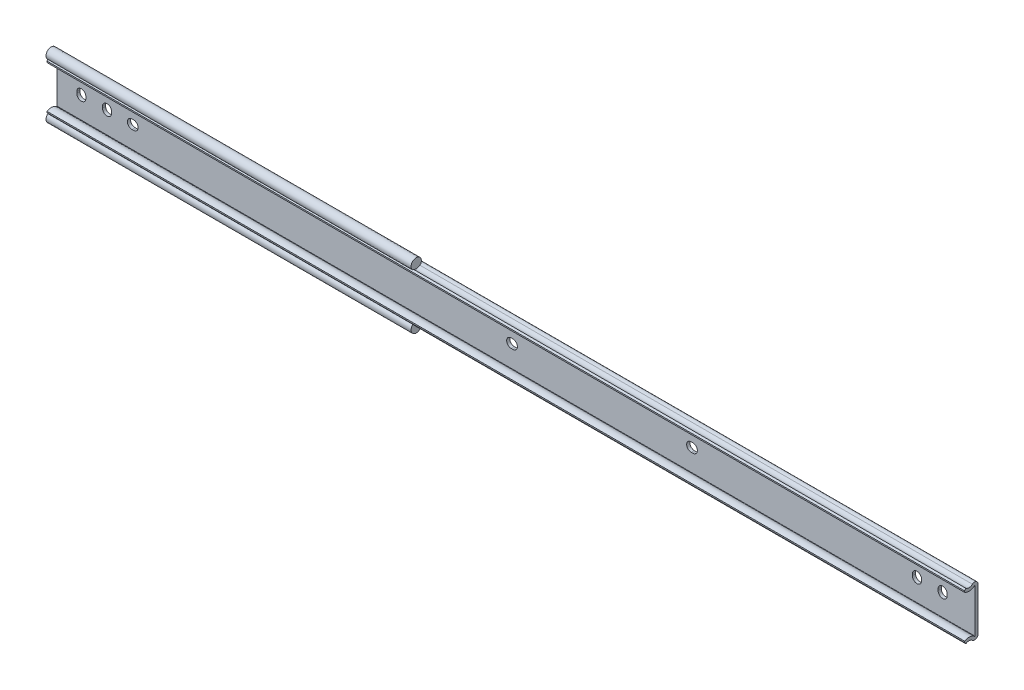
ISO-10303-21;
HEADER;
FILE_DESCRIPTION(('STEP AP214'),'2;1');
FILE_NAME('part.step','',(''),(''),'','','');
FILE_SCHEMA(('AUTOMOTIVE_DESIGN { 1 0 10303 214 1 1 1 1 }'));
ENDSEC;
DATA;
#1=APPLICATION_CONTEXT('core data for automotive mechanical design processes');
#2=APPLICATION_PROTOCOL_DEFINITION('international standard','automotive_design',2000,#1);
#3=PRODUCT_CONTEXT('',#1,'mechanical');
#4=PRODUCT('Part','Part','',(#3));
#5=PRODUCT_RELATED_PRODUCT_CATEGORY('part','',(#4));
#6=PRODUCT_DEFINITION_FORMATION('','',#4);
#7=PRODUCT_DEFINITION_CONTEXT('part definition',#1,'design');
#8=PRODUCT_DEFINITION('design','',#6,#7);
#9=PRODUCT_DEFINITION_SHAPE('','',#8);
#10=(LENGTH_UNIT() NAMED_UNIT(*) SI_UNIT(.MILLI.,.METRE.));
#11=(NAMED_UNIT(*) PLANE_ANGLE_UNIT() SI_UNIT($,.RADIAN.));
#12=(NAMED_UNIT(*) SI_UNIT($,.STERADIAN.) SOLID_ANGLE_UNIT());
#13=UNCERTAINTY_MEASURE_WITH_UNIT(LENGTH_MEASURE(1.E-05),#10,'distance_accuracy_value','');
#14=(GEOMETRIC_REPRESENTATION_CONTEXT(3) GLOBAL_UNCERTAINTY_ASSIGNED_CONTEXT((#13)) GLOBAL_UNIT_ASSIGNED_CONTEXT((#10,
#11,#12)) REPRESENTATION_CONTEXT('',''));
#15=CARTESIAN_POINT('',(0.,0.,0.));
#16=DIRECTION('',(0.,0.,1.));
#17=DIRECTION('',(1.,0.,0.));
#18=AXIS2_PLACEMENT_3D('',#15,#16,#17);
#19=CARTESIAN_POINT('',(-11.9,13.9150000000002,4.44999999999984));
#20=DIRECTION('',(1.,0.,0.));
#21=DIRECTION('',(0.,0.,-1.));
#22=AXIS2_PLACEMENT_3D('',#19,#20,#21);
#23=CYLINDRICAL_SURFACE('',#22,2.55000000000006);
#24=DIRECTION('',(1.,0.,0.));
#25=VECTOR('',#24,1.);
#26=CARTESIAN_POINT('',(-11.9,12.0059666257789,2.75941087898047));
#27=LINE('',#26,#25);
#28=CARTESIAN_POINT('',(168.4,12.0059666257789,2.75941087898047));
#29=VERTEX_POINT('',#28);
#30=CARTESIAN_POINT('',(441.3,12.0059666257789,2.75941087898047));
#31=VERTEX_POINT('',#30);
#32=EDGE_CURVE('E560',#29,#31,#27,.T.);
#33=ORIENTED_EDGE('',*,*,#32,.F.);
#34=CARTESIAN_POINT('',(168.4,13.9150000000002,4.44999999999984));
#35=DIRECTION('',(-1.,0.,0.));
#36=DIRECTION('',(0.,0.,1.));
#37=AXIS2_PLACEMENT_3D('',#34,#35,#36);
#38=CIRCLE('',#37,2.55000000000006);
#39=CARTESIAN_POINT('',(168.4,11.8784795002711,5.98462837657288));
#40=VERTEX_POINT('',#39);
#41=EDGE_CURVE('E333',#29,#40,#38,.T.);
#42=ORIENTED_EDGE('',*,*,#41,.T.);
#43=DIRECTION('',(1.,0.,0.));
#44=VECTOR('',#43,1.);
#45=CARTESIAN_POINT('',(-11.9,11.8784795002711,5.98462837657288));
#46=LINE('',#45,#44);
#47=CARTESIAN_POINT('',(441.3,11.8784795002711,5.98462837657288));
#48=VERTEX_POINT('',#47);
#49=EDGE_CURVE('E559',#40,#48,#46,.T.);
#50=ORIENTED_EDGE('',*,*,#49,.T.);
#51=CARTESIAN_POINT('',(441.3,13.9150000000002,4.44999999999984));
#52=DIRECTION('',(-1.,0.,0.));
#53=DIRECTION('',(0.,0.,1.));
#54=AXIS2_PLACEMENT_3D('',#51,#52,#53);
#55=CIRCLE('',#54,2.55000000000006);
#56=EDGE_CURVE('E487',#31,#48,#55,.T.);
#57=ORIENTED_EDGE('',*,*,#56,.F.);
#58=EDGE_LOOP('',(#33,#42,#50,#57));
#59=FACE_BOUND('',#58,.T.);
#60=ADVANCED_FACE('F14',(#59),#23,.F.);
#61=CARTESIAN_POINT('',(-11.9,-10.7622239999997,0.));
#62=DIRECTION('',(0.,0.,-1.));
#63=DIRECTION('',(-1.,0.,0.));
#64=AXIS2_PLACEMENT_3D('',#61,#62,#63);
#65=PLANE('',#64);
#66=DIRECTION('',(0.,1.,0.));
#67=VECTOR('',#66,1.);
#68=CARTESIAN_POINT('',(-11.9,-10.7622239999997,0.));
#69=LINE('',#68,#67);
#70=CARTESIAN_POINT('',(-11.9,-10.7622239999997,0.));
#71=VERTEX_POINT('',#70);
#72=CARTESIAN_POINT('',(-11.9,10.7622240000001,0.));
#73=VERTEX_POINT('',#72);
#74=EDGE_CURVE('E555',#71,#73,#69,.T.);
#75=ORIENTED_EDGE('',*,*,#74,.T.);
#76=DIRECTION('',(1.,0.,0.));
#77=VECTOR('',#76,1.);
#78=CARTESIAN_POINT('',(-11.9,10.7622240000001,0.));
#79=LINE('',#78,#77);
#80=CARTESIAN_POINT('',(441.3,10.7622240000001,0.));
#81=VERTEX_POINT('',#80);
#82=EDGE_CURVE('E563',#73,#81,#79,.T.);
#83=ORIENTED_EDGE('',*,*,#82,.T.);
#84=DIRECTION('',(0.,1.,0.));
#85=VECTOR('',#84,1.);
#86=CARTESIAN_POINT('',(441.3,-10.7622239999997,0.));
#87=LINE('',#86,#85);
#88=CARTESIAN_POINT('',(441.3,-10.7622239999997,0.));
#89=VERTEX_POINT('',#88);
#90=EDGE_CURVE('E528',#89,#81,#87,.T.);
#91=ORIENTED_EDGE('',*,*,#90,.F.);
#92=DIRECTION('',(1.,0.,0.));
#93=VECTOR('',#92,1.);
#94=CARTESIAN_POINT('',(-11.9,-10.7622239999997,0.));
#95=LINE('',#94,#93);
#96=EDGE_CURVE('E565',#71,#89,#95,.T.);
#97=ORIENTED_EDGE('',*,*,#96,.F.);
#98=EDGE_LOOP('',(#75,#83,#91,#97));
#99=FACE_BOUND('',#98,.T.);
#100=CARTESIAN_POINT('',(302.,2.32452945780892E-13,0.));
#101=DIRECTION('',(0.,0.,-1.));
#102=DIRECTION('',(-1.,0.,0.));
#103=AXIS2_PLACEMENT_3D('',#100,#101,#102);
#104=CIRCLE('',#103,2.25);
#105=CARTESIAN_POINT('',(302.,2.25000000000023,0.));
#106=VERTEX_POINT('',#105);
#107=CARTESIAN_POINT('',(302.,-2.24999999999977,0.));
#108=VERTEX_POINT('',#107);
#109=EDGE_CURVE('E350',#106,#108,#104,.T.);
#110=ORIENTED_EDGE('',*,*,#109,.F.);
#111=DIRECTION('',(1.,0.,0.));
#112=VECTOR('',#111,1.);
#113=CARTESIAN_POINT('',(302.,2.25000000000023,0.));
#114=LINE('',#113,#112);
#115=CARTESIAN_POINT('',(301.2,2.25000000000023,0.));
#116=VERTEX_POINT('',#115);
#117=EDGE_CURVE('E358',#116,#106,#114,.T.);
#118=ORIENTED_EDGE('',*,*,#117,.F.);
#119=CARTESIAN_POINT('',(301.2,2.32452945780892E-13,0.));
#120=DIRECTION('',(0.,0.,-1.));
#121=DIRECTION('',(-1.,0.,0.));
#122=AXIS2_PLACEMENT_3D('',#119,#120,#121);
#123=CIRCLE('',#122,2.25);
#124=CARTESIAN_POINT('',(301.2,-2.24999999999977,0.));
#125=VERTEX_POINT('',#124);
#126=EDGE_CURVE('E355',#125,#116,#123,.T.);
#127=ORIENTED_EDGE('',*,*,#126,.F.);
#128=DIRECTION('',(-1.,0.,0.));
#129=VECTOR('',#128,1.);
#130=CARTESIAN_POINT('',(302.,-2.24999999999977,0.));
#131=LINE('',#130,#129);
#132=EDGE_CURVE('E352',#108,#125,#131,.T.);
#133=ORIENTED_EDGE('',*,*,#132,.F.);
#134=EDGE_LOOP('',(#110,#118,#127,#133));
#135=FACE_BOUND('',#134,.T.);
#136=CARTESIAN_POINT('',(212.300000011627,0.00222400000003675,0.));
#137=DIRECTION('',(0.,0.,-1.));
#138=DIRECTION('',(-1.,0.,0.));
#139=AXIS2_PLACEMENT_3D('',#136,#137,#138);
#140=CIRCLE('',#139,2.25);
#141=CARTESIAN_POINT('',(212.300000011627,-2.24777599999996,0.));
#142=VERTEX_POINT('',#141);
#143=CARTESIAN_POINT('',(212.300000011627,2.25222400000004,0.));
#144=VERTEX_POINT('',#143);
#145=EDGE_CURVE('E373',#142,#144,#140,.T.);
#146=ORIENTED_EDGE('',*,*,#145,.F.);
#147=DIRECTION('',(-1.,0.,0.));
#148=VECTOR('',#147,1.);
#149=CARTESIAN_POINT('',(213.100000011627,-2.24777599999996,0.));
#150=LINE('',#149,#148);
#151=CARTESIAN_POINT('',(213.100000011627,-2.24777599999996,0.));
#152=VERTEX_POINT('',#151);
#153=EDGE_CURVE('E381',#152,#142,#150,.T.);
#154=ORIENTED_EDGE('',*,*,#153,.F.);
#155=CARTESIAN_POINT('',(213.100000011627,0.00222400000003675,0.));
#156=DIRECTION('',(0.,0.,-1.));
#157=DIRECTION('',(-1.,0.,0.));
#158=AXIS2_PLACEMENT_3D('',#155,#156,#157);
#159=CIRCLE('',#158,2.25);
#160=CARTESIAN_POINT('',(213.100000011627,2.25222400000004,0.));
#161=VERTEX_POINT('',#160);
#162=EDGE_CURVE('E378',#161,#152,#159,.T.);
#163=ORIENTED_EDGE('',*,*,#162,.F.);
#164=DIRECTION('',(1.,0.,0.));
#165=VECTOR('',#164,1.);
#166=CARTESIAN_POINT('',(212.300000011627,2.25222400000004,0.));
#167=LINE('',#166,#165);
#168=EDGE_CURVE('E375',#144,#161,#167,.T.);
#169=ORIENTED_EDGE('',*,*,#168,.F.);
#170=EDGE_LOOP('',(#146,#154,#163,#169));
#171=FACE_BOUND('',#170,.T.);
#172=CARTESIAN_POINT('',(25.0000000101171,0.00284489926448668,0.));
#173=DIRECTION('',(0.,0.,-1.));
#174=DIRECTION('',(-1.,0.,0.));
#175=AXIS2_PLACEMENT_3D('',#172,#173,#174);
#176=CIRCLE('',#175,2.25);
#177=CARTESIAN_POINT('',(25.0000000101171,-2.24715510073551,0.));
#178=VERTEX_POINT('',#177);
#179=CARTESIAN_POINT('',(25.0000000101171,2.25284489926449,0.));
#180=VERTEX_POINT('',#179);
#181=EDGE_CURVE('E387',#178,#180,#176,.T.);
#182=ORIENTED_EDGE('',*,*,#181,.F.);
#183=DIRECTION('',(-1.,0.,0.));
#184=VECTOR('',#183,1.);
#185=CARTESIAN_POINT('',(25.800000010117,-2.24715510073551,0.));
#186=LINE('',#185,#184);
#187=CARTESIAN_POINT('',(25.800000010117,-2.24715510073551,0.));
#188=VERTEX_POINT('',#187);
#189=EDGE_CURVE('E401',#188,#178,#186,.T.);
#190=ORIENTED_EDGE('',*,*,#189,.F.);
#191=CARTESIAN_POINT('',(25.800000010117,0.00284489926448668,0.));
#192=DIRECTION('',(0.,0.,-1.));
#193=DIRECTION('',(-1.,0.,0.));
#194=AXIS2_PLACEMENT_3D('',#191,#192,#193);
#195=CIRCLE('',#194,2.25);
#196=CARTESIAN_POINT('',(25.800000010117,2.25284489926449,0.));
#197=VERTEX_POINT('',#196);
#198=EDGE_CURVE('E398',#197,#188,#195,.T.);
#199=ORIENTED_EDGE('',*,*,#198,.F.);
#200=DIRECTION('',(1.,0.,0.));
#201=VECTOR('',#200,1.);
#202=CARTESIAN_POINT('',(25.0000000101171,2.25284489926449,0.));
#203=LINE('',#202,#201);
#204=EDGE_CURVE('E395',#180,#197,#203,.T.);
#205=ORIENTED_EDGE('',*,*,#204,.F.);
#206=EDGE_LOOP('',(#182,#190,#199,#205));
#207=FACE_BOUND('',#206,.T.);
#208=CARTESIAN_POINT('',(0.,-0.400000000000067,0.));
#209=DIRECTION('',(0.,0.,-1.));
#210=DIRECTION('',(1.,0.,0.));
#211=AXIS2_PLACEMENT_3D('',#208,#209,#210);
#212=CIRCLE('',#211,2.24999999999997);
#213=CARTESIAN_POINT('',(2.25000000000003,-0.400000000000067,0.));
#214=VERTEX_POINT('',#213);
#215=CARTESIAN_POINT('',(-2.24999999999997,-0.400000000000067,0.));
#216=VERTEX_POINT('',#215);
#217=EDGE_CURVE('E407',#214,#216,#212,.T.);
#218=ORIENTED_EDGE('',*,*,#217,.F.);
#219=DIRECTION('',(0.,-1.,0.));
#220=VECTOR('',#219,1.);
#221=CARTESIAN_POINT('',(2.25000000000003,-0.400000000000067,0.));
#222=LINE('',#221,#220);
#223=CARTESIAN_POINT('',(2.25000000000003,0.400000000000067,0.));
#224=VERTEX_POINT('',#223);
#225=EDGE_CURVE('E421',#224,#214,#222,.T.);
#226=ORIENTED_EDGE('',*,*,#225,.F.);
#227=CARTESIAN_POINT('',(0.,0.400000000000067,0.));
#228=DIRECTION('',(0.,0.,-1.));
#229=DIRECTION('',(1.,0.,0.));
#230=AXIS2_PLACEMENT_3D('',#227,#228,#229);
#231=CIRCLE('',#230,2.24999999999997);
#232=CARTESIAN_POINT('',(-2.24999999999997,0.400000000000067,0.));
#233=VERTEX_POINT('',#232);
#234=EDGE_CURVE('E418',#233,#224,#231,.T.);
#235=ORIENTED_EDGE('',*,*,#234,.F.);
#236=DIRECTION('',(0.,1.,0.));
#237=VECTOR('',#236,1.);
#238=CARTESIAN_POINT('',(-2.24999999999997,-0.400000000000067,0.));
#239=LINE('',#238,#237);
#240=EDGE_CURVE('E415',#216,#233,#239,.T.);
#241=ORIENTED_EDGE('',*,*,#240,.F.);
#242=EDGE_LOOP('',(#218,#226,#235,#241));
#243=FACE_BOUND('',#242,.T.);
#244=CARTESIAN_POINT('',(12.7,-0.400000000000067,0.));
#245=DIRECTION('',(0.,0.,-1.));
#246=DIRECTION('',(1.,0.,0.));
#247=AXIS2_PLACEMENT_3D('',#244,#245,#246);
#248=CIRCLE('',#247,2.24999999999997);
#249=CARTESIAN_POINT('',(14.95,-0.400000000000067,0.));
#250=VERTEX_POINT('',#249);
#251=CARTESIAN_POINT('',(10.45,-0.400000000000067,0.));
#252=VERTEX_POINT('',#251);
#253=EDGE_CURVE('E427',#250,#252,#248,.T.);
#254=ORIENTED_EDGE('',*,*,#253,.F.);
#255=DIRECTION('',(0.,-1.,0.));
#256=VECTOR('',#255,1.);
#257=CARTESIAN_POINT('',(14.95,-0.400000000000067,0.));
#258=LINE('',#257,#256);
#259=CARTESIAN_POINT('',(14.95,0.400000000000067,0.));
#260=VERTEX_POINT('',#259);
#261=EDGE_CURVE('E441',#260,#250,#258,.T.);
#262=ORIENTED_EDGE('',*,*,#261,.F.);
#263=CARTESIAN_POINT('',(12.7,0.400000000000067,0.));
#264=DIRECTION('',(0.,0.,-1.));
#265=DIRECTION('',(1.,0.,0.));
#266=AXIS2_PLACEMENT_3D('',#263,#264,#265);
#267=CIRCLE('',#266,2.24999999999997);
#268=CARTESIAN_POINT('',(10.45,0.400000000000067,0.));
#269=VERTEX_POINT('',#268);
#270=EDGE_CURVE('E438',#269,#260,#267,.T.);
#271=ORIENTED_EDGE('',*,*,#270,.F.);
#272=DIRECTION('',(0.,1.,0.));
#273=VECTOR('',#272,1.);
#274=CARTESIAN_POINT('',(10.45,-0.400000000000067,0.));
#275=LINE('',#274,#273);
#276=EDGE_CURVE('E435',#252,#269,#275,.T.);
#277=ORIENTED_EDGE('',*,*,#276,.F.);
#278=EDGE_LOOP('',(#254,#262,#271,#277));
#279=FACE_BOUND('',#278,.T.);
#280=CARTESIAN_POINT('',(412.7,-0.400000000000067,0.));
#281=DIRECTION('',(0.,0.,-1.));
#282=DIRECTION('',(1.,0.,0.));
#283=AXIS2_PLACEMENT_3D('',#280,#281,#282);
#284=CIRCLE('',#283,2.24999999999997);
#285=CARTESIAN_POINT('',(414.95,-0.400000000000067,0.));
#286=VERTEX_POINT('',#285);
#287=CARTESIAN_POINT('',(410.45,-0.400000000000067,0.));
#288=VERTEX_POINT('',#287);
#289=EDGE_CURVE('E447',#286,#288,#284,.T.);
#290=ORIENTED_EDGE('',*,*,#289,.F.);
#291=DIRECTION('',(0.,-1.,0.));
#292=VECTOR('',#291,1.);
#293=CARTESIAN_POINT('',(414.95,-0.400000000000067,0.));
#294=LINE('',#293,#292);
#295=CARTESIAN_POINT('',(414.95,0.400000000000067,0.));
#296=VERTEX_POINT('',#295);
#297=EDGE_CURVE('E461',#296,#286,#294,.T.);
#298=ORIENTED_EDGE('',*,*,#297,.F.);
#299=CARTESIAN_POINT('',(412.7,0.400000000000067,0.));
#300=DIRECTION('',(0.,0.,-1.));
#301=DIRECTION('',(1.,0.,0.));
#302=AXIS2_PLACEMENT_3D('',#299,#300,#301);
#303=CIRCLE('',#302,2.24999999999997);
#304=CARTESIAN_POINT('',(410.45,0.400000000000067,0.));
#305=VERTEX_POINT('',#304);
#306=EDGE_CURVE('E458',#305,#296,#303,.T.);
#307=ORIENTED_EDGE('',*,*,#306,.F.);
#308=DIRECTION('',(0.,1.,0.));
#309=VECTOR('',#308,1.);
#310=CARTESIAN_POINT('',(410.45,-0.400000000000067,0.));
#311=LINE('',#310,#309);
#312=EDGE_CURVE('E455',#288,#305,#311,.T.);
#313=ORIENTED_EDGE('',*,*,#312,.F.);
#314=EDGE_LOOP('',(#290,#298,#307,#313));
#315=FACE_BOUND('',#314,.T.);
#316=CARTESIAN_POINT('',(425.4,-0.400000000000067,0.));
#317=DIRECTION('',(0.,0.,-1.));
#318=DIRECTION('',(1.,0.,0.));
#319=AXIS2_PLACEMENT_3D('',#316,#317,#318);
#320=CIRCLE('',#319,2.24999999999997);
#321=CARTESIAN_POINT('',(427.65,-0.400000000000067,0.));
#322=VERTEX_POINT('',#321);
#323=CARTESIAN_POINT('',(423.15,-0.400000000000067,0.));
#324=VERTEX_POINT('',#323);
#325=EDGE_CURVE('E467',#322,#324,#320,.T.);
#326=ORIENTED_EDGE('',*,*,#325,.F.);
#327=DIRECTION('',(0.,-1.,0.));
#328=VECTOR('',#327,1.);
#329=CARTESIAN_POINT('',(427.65,-0.400000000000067,0.));
#330=LINE('',#329,#328);
#331=CARTESIAN_POINT('',(427.65,0.400000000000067,0.));
#332=VERTEX_POINT('',#331);
#333=EDGE_CURVE('E481',#332,#322,#330,.T.);
#334=ORIENTED_EDGE('',*,*,#333,.F.);
#335=CARTESIAN_POINT('',(425.4,0.400000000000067,0.));
#336=DIRECTION('',(0.,0.,-1.));
#337=DIRECTION('',(1.,0.,0.));
#338=AXIS2_PLACEMENT_3D('',#335,#336,#337);
#339=CIRCLE('',#338,2.24999999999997);
#340=CARTESIAN_POINT('',(423.15,0.400000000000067,0.));
#341=VERTEX_POINT('',#340);
#342=EDGE_CURVE('E478',#341,#332,#339,.T.);
#343=ORIENTED_EDGE('',*,*,#342,.F.);
#344=DIRECTION('',(0.,1.,0.));
#345=VECTOR('',#344,1.);
#346=CARTESIAN_POINT('',(423.15,-0.400000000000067,0.));
#347=LINE('',#346,#345);
#348=EDGE_CURVE('E475',#324,#341,#347,.T.);
#349=ORIENTED_EDGE('',*,*,#348,.F.);
#350=EDGE_LOOP('',(#326,#334,#343,#349));
#351=FACE_BOUND('',#350,.T.);
#352=ADVANCED_FACE('F669',(#99,#135,#171,#207,#243,#279,#315,#351),#65,.T.);
#353=CARTESIAN_POINT('',(-11.9,10.7622240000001,1.54999999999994));
#354=DIRECTION('',(0.,0.,1.));
#355=DIRECTION('',(1.,0.,0.));
#356=AXIS2_PLACEMENT_3D('',#353,#354,#355);
#357=PLANE('',#356);
#358=DIRECTION('',(0.,-1.,0.));
#359=VECTOR('',#358,1.);
#360=CARTESIAN_POINT('',(-11.9,10.7622240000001,1.54999999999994));
#361=LINE('',#360,#359);
#362=CARTESIAN_POINT('',(-11.9,10.7622240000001,1.54999999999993));
#363=VERTEX_POINT('',#362);
#364=CARTESIAN_POINT('',(-11.9,-10.7622239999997,1.54999999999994));
#365=VERTEX_POINT('',#364);
#366=EDGE_CURVE('E540',#363,#365,#361,.T.);
#367=ORIENTED_EDGE('',*,*,#366,.T.);
#368=DIRECTION('',(1.,0.,0.));
#369=VECTOR('',#368,1.);
#370=CARTESIAN_POINT('',(-11.9,-10.7622239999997,1.54999999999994));
#371=LINE('',#370,#369);
#372=CARTESIAN_POINT('',(441.3,-10.7622239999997,1.54999999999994));
#373=VERTEX_POINT('',#372);
#374=EDGE_CURVE('E578',#365,#373,#371,.T.);
#375=ORIENTED_EDGE('',*,*,#374,.T.);
#376=DIRECTION('',(0.,-1.,0.));
#377=VECTOR('',#376,1.);
#378=CARTESIAN_POINT('',(441.3,10.7622240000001,1.54999999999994));
#379=LINE('',#378,#377);
#380=CARTESIAN_POINT('',(441.3,10.7622240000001,1.54999999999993));
#381=VERTEX_POINT('',#380);
#382=EDGE_CURVE('E508',#381,#373,#379,.T.);
#383=ORIENTED_EDGE('',*,*,#382,.F.);
#384=DIRECTION('',(1.,0.,0.));
#385=VECTOR('',#384,1.);
#386=CARTESIAN_POINT('',(-11.9,10.7622240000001,1.54999999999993));
#387=LINE('',#386,#385);
#388=EDGE_CURVE('E580',#363,#381,#387,.T.);
#389=ORIENTED_EDGE('',*,*,#388,.F.);
#390=EDGE_LOOP('',(#367,#375,#383,#389));
#391=FACE_BOUND('',#390,.T.);
#392=CARTESIAN_POINT('',(302.,2.32452945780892E-13,1.54999999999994));
#393=DIRECTION('',(0.,0.,1.));
#394=DIRECTION('',(1.,0.,0.));
#395=AXIS2_PLACEMENT_3D('',#392,#393,#394);
#396=CIRCLE('',#395,2.25);
#397=CARTESIAN_POINT('',(302.,2.25000000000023,1.54999999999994));
#398=VERTEX_POINT('',#397);
#399=CARTESIAN_POINT('',(302.,-2.24999999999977,1.54999999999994));
#400=VERTEX_POINT('',#399);
#401=EDGE_CURVE('E347',#398,#400,#396,.F.);
#402=ORIENTED_EDGE('',*,*,#401,.T.);
#403=DIRECTION('',(-1.,0.,0.));
#404=VECTOR('',#403,1.);
#405=CARTESIAN_POINT('',(302.,-2.24999999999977,1.54999999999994));
#406=LINE('',#405,#404);
#407=CARTESIAN_POINT('',(301.2,-2.24999999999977,1.54999999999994));
#408=VERTEX_POINT('',#407);
#409=EDGE_CURVE('E364',#400,#408,#406,.T.);
#410=ORIENTED_EDGE('',*,*,#409,.T.);
#411=CARTESIAN_POINT('',(301.2,2.32452945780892E-13,1.54999999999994));
#412=DIRECTION('',(0.,0.,1.));
#413=DIRECTION('',(1.,0.,0.));
#414=AXIS2_PLACEMENT_3D('',#411,#412,#413);
#415=CIRCLE('',#414,2.25);
#416=CARTESIAN_POINT('',(301.2,2.25000000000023,1.54999999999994));
#417=VERTEX_POINT('',#416);
#418=EDGE_CURVE('E341',#408,#417,#415,.F.);
#419=ORIENTED_EDGE('',*,*,#418,.T.);
#420=DIRECTION('',(1.,0.,0.));
#421=VECTOR('',#420,1.);
#422=CARTESIAN_POINT('',(302.,2.25000000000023,1.54999999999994));
#423=LINE('',#422,#421);
#424=EDGE_CURVE('E344',#417,#398,#423,.T.);
#425=ORIENTED_EDGE('',*,*,#424,.T.);
#426=EDGE_LOOP('',(#402,#410,#419,#425));
#427=FACE_BOUND('',#426,.T.);
#428=CARTESIAN_POINT('',(212.300000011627,0.00222400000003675,1.54999999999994));
#429=DIRECTION('',(0.,0.,1.));
#430=DIRECTION('',(1.,0.,0.));
#431=AXIS2_PLACEMENT_3D('',#428,#429,#430);
#432=CIRCLE('',#431,2.25);
#433=CARTESIAN_POINT('',(212.300000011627,2.25222400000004,1.54999999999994));
#434=VERTEX_POINT('',#433);
#435=CARTESIAN_POINT('',(212.300000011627,-2.24777599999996,1.54999999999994));
#436=VERTEX_POINT('',#435);
#437=EDGE_CURVE('E640',#434,#436,#432,.T.);
#438=ORIENTED_EDGE('',*,*,#437,.F.);
#439=DIRECTION('',(-1.,0.,0.));
#440=VECTOR('',#439,1.);
#441=CARTESIAN_POINT('',(-11.9,2.25222400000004,1.54999999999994));
#442=LINE('',#441,#440);
#443=CARTESIAN_POINT('',(213.100000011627,2.25222400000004,1.54999999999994));
#444=VERTEX_POINT('',#443);
#445=EDGE_CURVE('E633',#444,#434,#442,.T.);
#446=ORIENTED_EDGE('',*,*,#445,.F.);
#447=CARTESIAN_POINT('',(213.100000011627,0.00222400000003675,1.54999999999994));
#448=DIRECTION('',(0.,0.,1.));
#449=DIRECTION('',(1.,0.,0.));
#450=AXIS2_PLACEMENT_3D('',#447,#448,#449);
#451=CIRCLE('',#450,2.25);
#452=CARTESIAN_POINT('',(213.100000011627,-2.24777599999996,1.54999999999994));
#453=VERTEX_POINT('',#452);
#454=EDGE_CURVE('E635',#453,#444,#451,.T.);
#455=ORIENTED_EDGE('',*,*,#454,.F.);
#456=DIRECTION('',(1.,0.,0.));
#457=VECTOR('',#456,1.);
#458=CARTESIAN_POINT('',(-11.9,-2.24777599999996,1.54999999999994));
#459=LINE('',#458,#457);
#460=EDGE_CURVE('E638',#436,#453,#459,.T.);
#461=ORIENTED_EDGE('',*,*,#460,.F.);
#462=EDGE_LOOP('',(#438,#446,#455,#461));
#463=FACE_BOUND('',#462,.T.);
#464=CARTESIAN_POINT('',(25.0000000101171,0.00284489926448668,1.54999999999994));
#465=DIRECTION('',(0.,0.,1.));
#466=DIRECTION('',(1.,0.,0.));
#467=AXIS2_PLACEMENT_3D('',#464,#465,#466);
#468=CIRCLE('',#467,2.25);
#469=CARTESIAN_POINT('',(25.0000000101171,2.25284489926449,1.54999999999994));
#470=VERTEX_POINT('',#469);
#471=CARTESIAN_POINT('',(25.0000000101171,-2.24715510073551,1.54999999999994));
#472=VERTEX_POINT('',#471);
#473=EDGE_CURVE('E631',#470,#472,#468,.T.);
#474=ORIENTED_EDGE('',*,*,#473,.F.);
#475=DIRECTION('',(-1.,0.,0.));
#476=VECTOR('',#475,1.);
#477=CARTESIAN_POINT('',(-11.9,2.25284489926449,1.54999999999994));
#478=LINE('',#477,#476);
#479=CARTESIAN_POINT('',(25.800000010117,2.25284489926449,1.54999999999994));
#480=VERTEX_POINT('',#479);
#481=EDGE_CURVE('E624',#480,#470,#478,.T.);
#482=ORIENTED_EDGE('',*,*,#481,.F.);
#483=CARTESIAN_POINT('',(25.800000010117,0.00284489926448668,1.54999999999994));
#484=DIRECTION('',(0.,0.,1.));
#485=DIRECTION('',(1.,0.,0.));
#486=AXIS2_PLACEMENT_3D('',#483,#484,#485);
#487=CIRCLE('',#486,2.25);
#488=CARTESIAN_POINT('',(25.800000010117,-2.24715510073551,1.54999999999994));
#489=VERTEX_POINT('',#488);
#490=EDGE_CURVE('E626',#489,#480,#487,.T.);
#491=ORIENTED_EDGE('',*,*,#490,.F.);
#492=DIRECTION('',(1.,0.,0.));
#493=VECTOR('',#492,1.);
#494=CARTESIAN_POINT('',(-11.9,-2.24715510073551,1.54999999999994));
#495=LINE('',#494,#493);
#496=EDGE_CURVE('E629',#472,#489,#495,.T.);
#497=ORIENTED_EDGE('',*,*,#496,.F.);
#498=EDGE_LOOP('',(#474,#482,#491,#497));
#499=FACE_BOUND('',#498,.T.);
#500=CARTESIAN_POINT('',(0.,-0.400000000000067,1.54999999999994));
#501=DIRECTION('',(0.,0.,1.));
#502=DIRECTION('',(1.,0.,0.));
#503=AXIS2_PLACEMENT_3D('',#500,#501,#502);
#504=CIRCLE('',#503,2.24999999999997);
#505=CARTESIAN_POINT('',(-2.24999999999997,-0.400000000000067,1.54999999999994));
#506=VERTEX_POINT('',#505);
#507=CARTESIAN_POINT('',(2.25000000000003,-0.400000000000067,1.54999999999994));
#508=VERTEX_POINT('',#507);
#509=EDGE_CURVE('E622',#506,#508,#504,.T.);
#510=ORIENTED_EDGE('',*,*,#509,.F.);
#511=DIRECTION('',(0.,-1.,0.));
#512=VECTOR('',#511,1.);
#513=CARTESIAN_POINT('',(-2.24999999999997,10.7622240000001,1.54999999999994));
#514=LINE('',#513,#512);
#515=CARTESIAN_POINT('',(-2.24999999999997,0.400000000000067,1.54999999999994));
#516=VERTEX_POINT('',#515);
#517=EDGE_CURVE('E615',#516,#506,#514,.T.);
#518=ORIENTED_EDGE('',*,*,#517,.F.);
#519=CARTESIAN_POINT('',(0.,0.400000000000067,1.54999999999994));
#520=DIRECTION('',(0.,0.,1.));
#521=DIRECTION('',(1.,0.,0.));
#522=AXIS2_PLACEMENT_3D('',#519,#520,#521);
#523=CIRCLE('',#522,2.24999999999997);
#524=CARTESIAN_POINT('',(2.25000000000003,0.400000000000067,1.54999999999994));
#525=VERTEX_POINT('',#524);
#526=EDGE_CURVE('E617',#525,#516,#523,.T.);
#527=ORIENTED_EDGE('',*,*,#526,.F.);
#528=DIRECTION('',(0.,1.,0.));
#529=VECTOR('',#528,1.);
#530=CARTESIAN_POINT('',(2.25000000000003,10.7622240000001,1.54999999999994));
#531=LINE('',#530,#529);
#532=EDGE_CURVE('E620',#508,#525,#531,.T.);
#533=ORIENTED_EDGE('',*,*,#532,.F.);
#534=EDGE_LOOP('',(#510,#518,#527,#533));
#535=FACE_BOUND('',#534,.T.);
#536=CARTESIAN_POINT('',(12.7,-0.400000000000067,1.54999999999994));
#537=DIRECTION('',(0.,0.,1.));
#538=DIRECTION('',(1.,0.,0.));
#539=AXIS2_PLACEMENT_3D('',#536,#537,#538);
#540=CIRCLE('',#539,2.24999999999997);
#541=CARTESIAN_POINT('',(10.45,-0.400000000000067,1.54999999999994));
#542=VERTEX_POINT('',#541);
#543=CARTESIAN_POINT('',(14.95,-0.400000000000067,1.54999999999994));
#544=VERTEX_POINT('',#543);
#545=EDGE_CURVE('E613',#542,#544,#540,.T.);
#546=ORIENTED_EDGE('',*,*,#545,.F.);
#547=DIRECTION('',(0.,-1.,0.));
#548=VECTOR('',#547,1.);
#549=CARTESIAN_POINT('',(10.45,10.7622240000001,1.54999999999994));
#550=LINE('',#549,#548);
#551=CARTESIAN_POINT('',(10.45,0.400000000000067,1.54999999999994));
#552=VERTEX_POINT('',#551);
#553=EDGE_CURVE('E606',#552,#542,#550,.T.);
#554=ORIENTED_EDGE('',*,*,#553,.F.);
#555=CARTESIAN_POINT('',(12.7,0.400000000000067,1.54999999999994));
#556=DIRECTION('',(0.,0.,1.));
#557=DIRECTION('',(1.,0.,0.));
#558=AXIS2_PLACEMENT_3D('',#555,#556,#557);
#559=CIRCLE('',#558,2.24999999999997);
#560=CARTESIAN_POINT('',(14.95,0.400000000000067,1.54999999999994));
#561=VERTEX_POINT('',#560);
#562=EDGE_CURVE('E608',#561,#552,#559,.T.);
#563=ORIENTED_EDGE('',*,*,#562,.F.);
#564=DIRECTION('',(0.,1.,0.));
#565=VECTOR('',#564,1.);
#566=CARTESIAN_POINT('',(14.95,10.7622240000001,1.54999999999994));
#567=LINE('',#566,#565);
#568=EDGE_CURVE('E611',#544,#561,#567,.T.);
#569=ORIENTED_EDGE('',*,*,#568,.F.);
#570=EDGE_LOOP('',(#546,#554,#563,#569));
#571=FACE_BOUND('',#570,.T.);
#572=CARTESIAN_POINT('',(412.7,-0.400000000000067,1.54999999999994));
#573=DIRECTION('',(0.,0.,1.));
#574=DIRECTION('',(1.,0.,0.));
#575=AXIS2_PLACEMENT_3D('',#572,#573,#574);
#576=CIRCLE('',#575,2.24999999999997);
#577=CARTESIAN_POINT('',(410.45,-0.400000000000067,1.54999999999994));
#578=VERTEX_POINT('',#577);
#579=CARTESIAN_POINT('',(414.95,-0.400000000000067,1.54999999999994));
#580=VERTEX_POINT('',#579);
#581=EDGE_CURVE('E604',#578,#580,#576,.T.);
#582=ORIENTED_EDGE('',*,*,#581,.F.);
#583=DIRECTION('',(0.,-1.,0.));
#584=VECTOR('',#583,1.);
#585=CARTESIAN_POINT('',(410.45,10.7622240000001,1.54999999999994));
#586=LINE('',#585,#584);
#587=CARTESIAN_POINT('',(410.45,0.400000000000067,1.54999999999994));
#588=VERTEX_POINT('',#587);
#589=EDGE_CURVE('E597',#588,#578,#586,.T.);
#590=ORIENTED_EDGE('',*,*,#589,.F.);
#591=CARTESIAN_POINT('',(412.7,0.400000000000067,1.54999999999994));
#592=DIRECTION('',(0.,0.,1.));
#593=DIRECTION('',(1.,0.,0.));
#594=AXIS2_PLACEMENT_3D('',#591,#592,#593);
#595=CIRCLE('',#594,2.24999999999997);
#596=CARTESIAN_POINT('',(414.95,0.400000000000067,1.54999999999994));
#597=VERTEX_POINT('',#596);
#598=EDGE_CURVE('E599',#597,#588,#595,.T.);
#599=ORIENTED_EDGE('',*,*,#598,.F.);
#600=DIRECTION('',(0.,1.,0.));
#601=VECTOR('',#600,1.);
#602=CARTESIAN_POINT('',(414.95,10.7622240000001,1.54999999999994));
#603=LINE('',#602,#601);
#604=EDGE_CURVE('E602',#580,#597,#603,.T.);
#605=ORIENTED_EDGE('',*,*,#604,.F.);
#606=EDGE_LOOP('',(#582,#590,#599,#605));
#607=FACE_BOUND('',#606,.T.);
#608=CARTESIAN_POINT('',(425.4,-0.400000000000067,1.54999999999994));
#609=DIRECTION('',(0.,0.,1.));
#610=DIRECTION('',(1.,0.,0.));
#611=AXIS2_PLACEMENT_3D('',#608,#609,#610);
#612=CIRCLE('',#611,2.24999999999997);
#613=CARTESIAN_POINT('',(423.15,-0.400000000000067,1.54999999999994));
#614=VERTEX_POINT('',#613);
#615=CARTESIAN_POINT('',(427.65,-0.400000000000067,1.54999999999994));
#616=VERTEX_POINT('',#615);
#617=EDGE_CURVE('E595',#614,#616,#612,.T.);
#618=ORIENTED_EDGE('',*,*,#617,.F.);
#619=DIRECTION('',(0.,-1.,0.));
#620=VECTOR('',#619,1.);
#621=CARTESIAN_POINT('',(423.15,10.7622240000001,1.54999999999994));
#622=LINE('',#621,#620);
#623=CARTESIAN_POINT('',(423.15,0.400000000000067,1.54999999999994));
#624=VERTEX_POINT('',#623);
#625=EDGE_CURVE('E562',#624,#614,#622,.T.);
#626=ORIENTED_EDGE('',*,*,#625,.F.);
#627=CARTESIAN_POINT('',(425.4,0.400000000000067,1.54999999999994));
#628=DIRECTION('',(0.,0.,1.));
#629=DIRECTION('',(1.,0.,0.));
#630=AXIS2_PLACEMENT_3D('',#627,#628,#629);
#631=CIRCLE('',#630,2.24999999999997);
#632=CARTESIAN_POINT('',(427.65,0.400000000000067,1.54999999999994));
#633=VERTEX_POINT('',#632);
#634=EDGE_CURVE('E590',#633,#624,#631,.T.);
#635=ORIENTED_EDGE('',*,*,#634,.F.);
#636=DIRECTION('',(0.,1.,0.));
#637=VECTOR('',#636,1.);
#638=CARTESIAN_POINT('',(427.65,10.7622240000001,1.54999999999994));
#639=LINE('',#638,#637);
#640=EDGE_CURVE('E593',#616,#633,#639,.T.);
#641=ORIENTED_EDGE('',*,*,#640,.F.);
#642=EDGE_LOOP('',(#618,#626,#635,#641));
#643=FACE_BOUND('',#642,.T.);
#644=ADVANCED_FACE('F700',(#391,#427,#463,#499,#535,#571,#607,#643),#357,.T.);
#645=CARTESIAN_POINT('',(-11.9,13.9150000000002,4.44999999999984));
#646=DIRECTION('',(-1.,0.,0.));
#647=DIRECTION('',(0.,0.,1.));
#648=AXIS2_PLACEMENT_3D('',#645,#646,#647);
#649=PLANE('',#648);
#650=CARTESIAN_POINT('',(-11.9,-10.7622239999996,1.66));
#651=DIRECTION('',(1.,0.,0.));
#652=DIRECTION('',(0.,0.,1.));
#653=AXIS2_PLACEMENT_3D('',#650,#651,#652);
#654=CIRCLE('',#653,1.66);
#655=CARTESIAN_POINT('',(-11.9,-12.2669175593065,2.36106867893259));
#656=VERTEX_POINT('',#655);
#657=EDGE_CURVE('E553',#656,#71,#654,.T.);
#658=ORIENTED_EDGE('',*,*,#657,.F.);
#659=CARTESIAN_POINT('',(-11.9,-13.5749999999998,4.55));
#660=DIRECTION('',(-1.,0.,0.));
#661=DIRECTION('',(0.,0.,-1.));
#662=AXIS2_PLACEMENT_3D('',#659,#660,#661);
#663=CIRCLE('',#662,2.55);
#664=CARTESIAN_POINT('',(-11.9,-11.6159967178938,6.18242339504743));
#665=VERTEX_POINT('',#664);
#666=EDGE_CURVE('E656',#656,#665,#663,.T.);
#667=ORIENTED_EDGE('',*,*,#666,.T.);
#668=DIRECTION('',(0.,-0.798635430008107,-0.60181512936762));
#669=VECTOR('',#668,1.);
#670=CARTESIAN_POINT('',(-11.9,-11.8784795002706,5.98462837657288));
#671=LINE('',#670,#669);
#672=CARTESIAN_POINT('',(-11.9,-11.0618539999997,6.6));
#673=VERTEX_POINT('',#672);
#674=EDGE_CURVE('E551',#673,#665,#671,.T.);
#675=ORIENTED_EDGE('',*,*,#674,.F.);
#676=DIRECTION('',(0.,-1.,0.));
#677=VECTOR('',#676,1.);
#678=CARTESIAN_POINT('',(-11.9,-11.0618539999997,6.6));
#679=LINE('',#678,#677);
#680=CARTESIAN_POINT('',(-11.9,-10.4239399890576,6.59999999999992));
#681=VERTEX_POINT('',#680);
#682=EDGE_CURVE('E548',#681,#673,#679,.T.);
#683=ORIENTED_EDGE('',*,*,#682,.F.);
#684=CARTESIAN_POINT('',(-11.9,-13.9149999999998,4.44999999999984));
#685=DIRECTION('',(1.,0.,0.));
#686=DIRECTION('',(0.,0.,1.));
#687=AXIS2_PLACEMENT_3D('',#684,#685,#686);
#688=CIRCLE('',#687,4.1);
#689=CARTESIAN_POINT('',(-11.9,-10.8444026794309,1.73312089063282));
#690=VERTEX_POINT('',#689);
#691=EDGE_CURVE('E545',#690,#681,#688,.T.);
#692=ORIENTED_EDGE('',*,*,#691,.F.);
#693=CARTESIAN_POINT('',(-11.9,-10.7622239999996,1.66));
#694=DIRECTION('',(-1.,0.,0.));
#695=DIRECTION('',(0.,0.,-1.));
#696=AXIS2_PLACEMENT_3D('',#693,#694,#695);
#697=CIRCLE('',#696,0.110000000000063);
#698=EDGE_CURVE('E542',#365,#690,#697,.T.);
#699=ORIENTED_EDGE('',*,*,#698,.F.);
#700=ORIENTED_EDGE('',*,*,#366,.F.);
#701=CARTESIAN_POINT('',(-11.9,10.762224,1.66));
#702=DIRECTION('',(-1.,0.,0.));
#703=DIRECTION('',(0.,0.,1.));
#704=AXIS2_PLACEMENT_3D('',#701,#702,#703);
#705=CIRCLE('',#704,0.110000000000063);
#706=CARTESIAN_POINT('',(-11.9,10.8444026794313,1.73312089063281));
#707=VERTEX_POINT('',#706);
#708=EDGE_CURVE('E537',#707,#363,#705,.T.);
#709=ORIENTED_EDGE('',*,*,#708,.F.);
#710=CARTESIAN_POINT('',(-11.9,13.9150000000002,4.44999999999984));
#711=DIRECTION('',(1.,0.,0.));
#712=DIRECTION('',(0.,0.,-1.));
#713=AXIS2_PLACEMENT_3D('',#710,#711,#712);
#714=CIRCLE('',#713,4.1);
#715=CARTESIAN_POINT('',(-11.9,10.423939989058,6.6));
#716=VERTEX_POINT('',#715);
#717=EDGE_CURVE('E534',#716,#707,#714,.T.);
#718=ORIENTED_EDGE('',*,*,#717,.F.);
#719=DIRECTION('',(0.,-1.,0.));
#720=VECTOR('',#719,1.);
#721=CARTESIAN_POINT('',(-11.9,11.0618540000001,6.6));
#722=LINE('',#721,#720);
#723=CARTESIAN_POINT('',(-11.9,11.0618540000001,6.6));
#724=VERTEX_POINT('',#723);
#725=EDGE_CURVE('E313',#724,#716,#722,.T.);
#726=ORIENTED_EDGE('',*,*,#725,.F.);
#727=DIRECTION('',(0.,-0.798635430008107,0.60181512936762));
#728=VECTOR('',#727,1.);
#729=CARTESIAN_POINT('',(-11.9,11.8784795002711,5.98462837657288));
#730=LINE('',#729,#728);
#731=CARTESIAN_POINT('',(-11.9,11.6159967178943,6.18242339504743));
#732=VERTEX_POINT('',#731);
#733=EDGE_CURVE('E305',#732,#724,#730,.T.);
#734=ORIENTED_EDGE('',*,*,#733,.F.);
#735=CARTESIAN_POINT('',(-11.9,13.5750000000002,4.55));
#736=DIRECTION('',(-1.,0.,0.));
#737=DIRECTION('',(0.,0.,1.));
#738=AXIS2_PLACEMENT_3D('',#735,#736,#737);
#739=CIRCLE('',#738,2.55);
#740=CARTESIAN_POINT('',(-11.9,12.266917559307,2.36106867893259));
#741=VERTEX_POINT('',#740);
#742=EDGE_CURVE('E310',#732,#741,#739,.T.);
#743=ORIENTED_EDGE('',*,*,#742,.T.);
#744=CARTESIAN_POINT('',(-11.9,10.762224,1.66));
#745=DIRECTION('',(1.,0.,0.));
#746=DIRECTION('',(0.,0.,-1.));
#747=AXIS2_PLACEMENT_3D('',#744,#745,#746);
#748=CIRCLE('',#747,1.66);
#749=EDGE_CURVE('E557',#73,#741,#748,.T.);
#750=ORIENTED_EDGE('',*,*,#749,.F.);
#751=ORIENTED_EDGE('',*,*,#74,.F.);
#752=EDGE_LOOP('',(#658,#667,#675,#683,#692,#699,#700,#709,#718,#726,#734,#743,#750,#751));
#753=FACE_BOUND('',#752,.T.);
#754=ADVANCED_FACE('F307',(#753),#649,.T.);
#755=CARTESIAN_POINT('',(-11.9,10.762224,1.66));
#756=DIRECTION('',(1.,0.,0.));
#757=DIRECTION('',(0.,0.,-1.));
#758=AXIS2_PLACEMENT_3D('',#755,#756,#757);
#759=CYLINDRICAL_SURFACE('',#758,1.66);
#760=DIRECTION('',(-1.,0.,0.));
#761=VECTOR('',#760,1.);
#762=CARTESIAN_POINT('',(78.25,12.266917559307,2.36106867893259));
#763=LINE('',#762,#761);
#764=CARTESIAN_POINT('',(168.4,12.266917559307,2.36106867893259));
#765=VERTEX_POINT('',#764);
#766=EDGE_CURVE('E330',#765,#741,#763,.T.);
#767=ORIENTED_EDGE('',*,*,#766,.F.);
#768=CARTESIAN_POINT('',(168.4,10.762224,1.66));
#769=DIRECTION('',(-1.,0.,0.));
#770=DIRECTION('',(0.,0.,1.));
#771=AXIS2_PLACEMENT_3D('',#768,#769,#770);
#772=CIRCLE('',#771,1.66);
#773=EDGE_CURVE('E338',#765,#29,#772,.F.);
#774=ORIENTED_EDGE('',*,*,#773,.T.);
#775=ORIENTED_EDGE('',*,*,#32,.T.);
#776=CARTESIAN_POINT('',(441.3,10.762224,1.66));
#777=DIRECTION('',(1.,0.,0.));
#778=DIRECTION('',(0.,0.,-1.));
#779=AXIS2_PLACEMENT_3D('',#776,#777,#778);
#780=CIRCLE('',#779,1.66);
#781=EDGE_CURVE('E316',#81,#31,#780,.T.);
#782=ORIENTED_EDGE('',*,*,#781,.F.);
#783=ORIENTED_EDGE('',*,*,#82,.F.);
#784=ORIENTED_EDGE('',*,*,#749,.T.);
#785=EDGE_LOOP('',(#767,#774,#775,#782,#783,#784));
#786=FACE_BOUND('',#785,.T.);
#787=ADVANCED_FACE('F677',(#786),#759,.T.);
#788=CARTESIAN_POINT('',(-11.9,-10.7622239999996,1.66));
#789=DIRECTION('',(1.,0.,0.));
#790=DIRECTION('',(0.,0.,-1.));
#791=AXIS2_PLACEMENT_3D('',#788,#789,#790);
#792=CYLINDRICAL_SURFACE('',#791,1.66);
#793=DIRECTION('',(-1.,0.,0.));
#794=VECTOR('',#793,1.);
#795=CARTESIAN_POINT('',(78.25,-12.2669175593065,2.36106867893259));
#796=LINE('',#795,#794);
#797=CARTESIAN_POINT('',(168.4,-12.2669175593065,2.36106867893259));
#798=VERTEX_POINT('',#797);
#799=EDGE_CURVE('E32',#656,#798,#796,.F.);
#800=ORIENTED_EDGE('',*,*,#799,.F.);
#801=ORIENTED_EDGE('',*,*,#657,.T.);
#802=ORIENTED_EDGE('',*,*,#96,.T.);
#803=CARTESIAN_POINT('',(441.3,-10.7622239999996,1.66));
#804=DIRECTION('',(1.,0.,0.));
#805=DIRECTION('',(0.,0.,1.));
#806=AXIS2_PLACEMENT_3D('',#803,#804,#805);
#807=CIRCLE('',#806,1.66);
#808=CARTESIAN_POINT('',(441.3,-12.0059666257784,2.75941087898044));
#809=VERTEX_POINT('',#808);
#810=EDGE_CURVE('E526',#809,#89,#807,.T.);
#811=ORIENTED_EDGE('',*,*,#810,.F.);
#812=DIRECTION('',(1.,0.,0.));
#813=VECTOR('',#812,1.);
#814=CARTESIAN_POINT('',(-11.9,-12.0059666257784,2.75941087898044));
#815=LINE('',#814,#813);
#816=CARTESIAN_POINT('',(168.4,-12.0059666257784,2.75941087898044));
#817=VERTEX_POINT('',#816);
#818=EDGE_CURVE('E568',#817,#809,#815,.T.);
#819=ORIENTED_EDGE('',*,*,#818,.F.);
#820=CARTESIAN_POINT('',(168.4,-10.7622239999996,1.66));
#821=DIRECTION('',(1.,0.,0.));
#822=DIRECTION('',(0.,0.,-1.));
#823=AXIS2_PLACEMENT_3D('',#820,#821,#822);
#824=CIRCLE('',#823,1.66);
#825=EDGE_CURVE('E28',#798,#817,#824,.F.);
#826=ORIENTED_EDGE('',*,*,#825,.F.);
#827=EDGE_LOOP('',(#800,#801,#802,#811,#819,#826));
#828=FACE_BOUND('',#827,.T.);
#829=ADVANCED_FACE('F665',(#828),#792,.T.);
#830=CARTESIAN_POINT('',(-11.9,-13.9149999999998,4.44999999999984));
#831=DIRECTION('',(1.,0.,0.));
#832=DIRECTION('',(0.,0.,-1.));
#833=AXIS2_PLACEMENT_3D('',#830,#831,#832);
#834=CYLINDRICAL_SURFACE('',#833,2.55000000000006);
#835=CARTESIAN_POINT('',(168.4,-13.9149999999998,4.44999999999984));
#836=DIRECTION('',(1.,0.,0.));
#837=DIRECTION('',(0.,0.,-1.));
#838=AXIS2_PLACEMENT_3D('',#835,#836,#837);
#839=CIRCLE('',#838,2.55000000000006);
#840=CARTESIAN_POINT('',(168.4,-11.8784795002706,5.98462837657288));
#841=VERTEX_POINT('',#840);
#842=EDGE_CURVE('E649',#817,#841,#839,.T.);
#843=ORIENTED_EDGE('',*,*,#842,.F.);
#844=ORIENTED_EDGE('',*,*,#818,.T.);
#845=CARTESIAN_POINT('',(441.3,-13.9149999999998,4.44999999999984));
#846=DIRECTION('',(-1.,0.,0.));
#847=DIRECTION('',(0.,0.,-1.));
#848=AXIS2_PLACEMENT_3D('',#845,#846,#847);
#849=CIRCLE('',#848,2.55000000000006);
#850=CARTESIAN_POINT('',(441.3,-11.8784795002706,5.98462837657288));
#851=VERTEX_POINT('',#850);
#852=EDGE_CURVE('E523',#851,#809,#849,.T.);
#853=ORIENTED_EDGE('',*,*,#852,.F.);
#854=DIRECTION('',(1.,0.,0.));
#855=VECTOR('',#854,1.);
#856=CARTESIAN_POINT('',(-11.9,-11.8784795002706,5.98462837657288));
#857=LINE('',#856,#855);
#858=EDGE_CURVE('E570',#841,#851,#857,.T.);
#859=ORIENTED_EDGE('',*,*,#858,.F.);
#860=EDGE_LOOP('',(#843,#844,#853,#859));
#861=FACE_BOUND('',#860,.T.);
#862=ADVANCED_FACE('F713',(#861),#834,.F.);
#863=CARTESIAN_POINT('',(-11.9,-11.8784795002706,5.98462837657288));
#864=DIRECTION('',(0.,-0.60181512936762,0.798635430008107));
#865=DIRECTION('',(0.,-0.798635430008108,-0.60181512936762));
#866=AXIS2_PLACEMENT_3D('',#863,#864,#865);
#867=PLANE('',#866);
#868=DIRECTION('',(-1.,0.,0.));
#869=VECTOR('',#868,1.);
#870=CARTESIAN_POINT('',(168.4,-11.6159967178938,6.18242339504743));
#871=LINE('',#870,#869);
#872=CARTESIAN_POINT('',(168.4,-11.6159967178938,6.18242339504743));
#873=VERTEX_POINT('',#872);
#874=EDGE_CURVE('E9',#873,#665,#871,.T.);
#875=ORIENTED_EDGE('',*,*,#874,.F.);
#876=DIRECTION('',(0.,0.798635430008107,0.60181512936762));
#877=VECTOR('',#876,1.);
#878=CARTESIAN_POINT('',(168.4,-11.8784795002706,5.98462837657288));
#879=LINE('',#878,#877);
#880=EDGE_CURVE('E21',#841,#873,#879,.T.);
#881=ORIENTED_EDGE('',*,*,#880,.F.);
#882=ORIENTED_EDGE('',*,*,#858,.T.);
#883=DIRECTION('',(0.,-0.798635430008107,-0.60181512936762));
#884=VECTOR('',#883,1.);
#885=CARTESIAN_POINT('',(441.3,-11.8784795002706,5.98462837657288));
#886=LINE('',#885,#884);
#887=CARTESIAN_POINT('',(441.3,-11.0618539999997,6.6));
#888=VERTEX_POINT('',#887);
#889=EDGE_CURVE('E520',#888,#851,#886,.T.);
#890=ORIENTED_EDGE('',*,*,#889,.F.);
#891=DIRECTION('',(1.,0.,0.));
#892=VECTOR('',#891,1.);
#893=CARTESIAN_POINT('',(-11.9,-11.0618539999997,6.6));
#894=LINE('',#893,#892);
#895=EDGE_CURVE('E572',#673,#888,#894,.T.);
#896=ORIENTED_EDGE('',*,*,#895,.F.);
#897=ORIENTED_EDGE('',*,*,#674,.T.);
#898=EDGE_LOOP('',(#875,#881,#882,#890,#896,#897));
#899=FACE_BOUND('',#898,.T.);
#900=ADVANCED_FACE('F716',(#899),#867,.T.);
#901=CARTESIAN_POINT('',(-11.9,-11.0618539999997,6.6));
#902=DIRECTION('',(0.,0.,1.));
#903=DIRECTION('',(1.,0.,0.));
#904=AXIS2_PLACEMENT_3D('',#901,#902,#903);
#905=PLANE('',#904);
#906=DIRECTION('',(0.,-1.,0.));
#907=VECTOR('',#906,1.);
#908=CARTESIAN_POINT('',(441.3,-11.0618539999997,6.6));
#909=LINE('',#908,#907);
#910=CARTESIAN_POINT('',(441.3,-10.4239399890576,6.59999999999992));
#911=VERTEX_POINT('',#910);
#912=EDGE_CURVE('E517',#911,#888,#909,.T.);
#913=ORIENTED_EDGE('',*,*,#912,.F.);
#914=DIRECTION('',(1.,0.,0.));
#915=VECTOR('',#914,1.);
#916=CARTESIAN_POINT('',(-11.9,-10.4239399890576,6.59999999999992));
#917=LINE('',#916,#915);
#918=EDGE_CURVE('E574',#681,#911,#917,.T.);
#919=ORIENTED_EDGE('',*,*,#918,.F.);
#920=ORIENTED_EDGE('',*,*,#682,.T.);
#921=ORIENTED_EDGE('',*,*,#895,.T.);
#922=EDGE_LOOP('',(#913,#919,#920,#921));
#923=FACE_BOUND('',#922,.T.);
#924=ADVANCED_FACE('F720',(#923),#905,.T.);
#925=CARTESIAN_POINT('',(-11.9,-13.9149999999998,4.44999999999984));
#926=DIRECTION('',(1.,0.,0.));
#927=DIRECTION('',(0.,0.,-1.));
#928=AXIS2_PLACEMENT_3D('',#925,#926,#927);
#929=CYLINDRICAL_SURFACE('',#928,4.1);
#930=CARTESIAN_POINT('',(441.3,-13.9149999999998,4.44999999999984));
#931=DIRECTION('',(1.,0.,0.));
#932=DIRECTION('',(0.,0.,1.));
#933=AXIS2_PLACEMENT_3D('',#930,#931,#932);
#934=CIRCLE('',#933,4.1);
#935=CARTESIAN_POINT('',(441.3,-10.8444026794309,1.73312089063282));
#936=VERTEX_POINT('',#935);
#937=EDGE_CURVE('E514',#936,#911,#934,.T.);
#938=ORIENTED_EDGE('',*,*,#937,.F.);
#939=DIRECTION('',(1.,0.,0.));
#940=VECTOR('',#939,1.);
#941=CARTESIAN_POINT('',(-11.9,-10.8444026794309,1.73312089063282));
#942=LINE('',#941,#940);
#943=EDGE_CURVE('E576',#690,#936,#942,.T.);
#944=ORIENTED_EDGE('',*,*,#943,.F.);
#945=ORIENTED_EDGE('',*,*,#691,.T.);
#946=ORIENTED_EDGE('',*,*,#918,.T.);
#947=EDGE_LOOP('',(#938,#944,#945,#946));
#948=FACE_BOUND('',#947,.T.);
#949=ADVANCED_FACE('F723',(#948),#929,.T.);
#950=CARTESIAN_POINT('',(-11.9,-10.7622239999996,1.66));
#951=DIRECTION('',(1.,0.,0.));
#952=DIRECTION('',(0.,0.,-1.));
#953=AXIS2_PLACEMENT_3D('',#950,#951,#952);
#954=CYLINDRICAL_SURFACE('',#953,0.110000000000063);
#955=CARTESIAN_POINT('',(441.3,-10.7622239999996,1.66));
#956=DIRECTION('',(-1.,0.,0.));
#957=DIRECTION('',(0.,0.,-1.));
#958=AXIS2_PLACEMENT_3D('',#955,#956,#957);
#959=CIRCLE('',#958,0.110000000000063);
#960=EDGE_CURVE('E511',#373,#936,#959,.T.);
#961=ORIENTED_EDGE('',*,*,#960,.F.);
#962=ORIENTED_EDGE('',*,*,#374,.F.);
#963=ORIENTED_EDGE('',*,*,#698,.T.);
#964=ORIENTED_EDGE('',*,*,#943,.T.);
#965=EDGE_LOOP('',(#961,#962,#963,#964));
#966=FACE_BOUND('',#965,.T.);
#967=ADVANCED_FACE('F727',(#966),#954,.F.);
#968=CARTESIAN_POINT('',(-11.9,10.762224,1.66));
#969=DIRECTION('',(1.,0.,0.));
#970=DIRECTION('',(0.,0.,-1.));
#971=AXIS2_PLACEMENT_3D('',#968,#969,#970);
#972=CYLINDRICAL_SURFACE('',#971,0.110000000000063);
#973=CARTESIAN_POINT('',(441.3,10.762224,1.66));
#974=DIRECTION('',(-1.,0.,0.));
#975=DIRECTION('',(0.,0.,1.));
#976=AXIS2_PLACEMENT_3D('',#973,#974,#975);
#977=CIRCLE('',#976,0.110000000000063);
#978=CARTESIAN_POINT('',(441.3,10.8444026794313,1.73312089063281));
#979=VERTEX_POINT('',#978);
#980=EDGE_CURVE('E505',#979,#381,#977,.T.);
#981=ORIENTED_EDGE('',*,*,#980,.F.);
#982=DIRECTION('',(1.,0.,0.));
#983=VECTOR('',#982,1.);
#984=CARTESIAN_POINT('',(-11.9,10.8444026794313,1.73312089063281));
#985=LINE('',#984,#983);
#986=EDGE_CURVE('E582',#707,#979,#985,.T.);
#987=ORIENTED_EDGE('',*,*,#986,.F.);
#988=ORIENTED_EDGE('',*,*,#708,.T.);
#989=ORIENTED_EDGE('',*,*,#388,.T.);
#990=EDGE_LOOP('',(#981,#987,#988,#989));
#991=FACE_BOUND('',#990,.T.);
#992=ADVANCED_FACE('F730',(#991),#972,.F.);
#993=CARTESIAN_POINT('',(-11.9,13.9150000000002,4.44999999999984));
#994=DIRECTION('',(1.,0.,0.));
#995=DIRECTION('',(0.,0.,-1.));
#996=AXIS2_PLACEMENT_3D('',#993,#994,#995);
#997=CYLINDRICAL_SURFACE('',#996,4.1);
#998=CARTESIAN_POINT('',(441.3,13.9150000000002,4.44999999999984));
#999=DIRECTION('',(1.,0.,0.));
#1000=DIRECTION('',(0.,0.,-1.));
#1001=AXIS2_PLACEMENT_3D('',#998,#999,#1000);
#1002=CIRCLE('',#1001,4.1);
#1003=CARTESIAN_POINT('',(441.3,10.423939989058,6.6));
#1004=VERTEX_POINT('',#1003);
#1005=EDGE_CURVE('E502',#1004,#979,#1002,.T.);
#1006=ORIENTED_EDGE('',*,*,#1005,.F.);
#1007=DIRECTION('',(1.,0.,0.));
#1008=VECTOR('',#1007,1.);
#1009=CARTESIAN_POINT('',(-11.9,10.423939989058,6.6));
#1010=LINE('',#1009,#1008);
#1011=EDGE_CURVE('E584',#716,#1004,#1010,.T.);
#1012=ORIENTED_EDGE('',*,*,#1011,.F.);
#1013=ORIENTED_EDGE('',*,*,#717,.T.);
#1014=ORIENTED_EDGE('',*,*,#986,.T.);
#1015=EDGE_LOOP('',(#1006,#1012,#1013,#1014));
#1016=FACE_BOUND('',#1015,.T.);
#1017=ADVANCED_FACE('F735',(#1016),#997,.T.);
#1018=CARTESIAN_POINT('',(-11.9,11.0618540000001,6.6));
#1019=DIRECTION('',(0.,0.,1.));
#1020=DIRECTION('',(1.,0.,0.));
#1021=AXIS2_PLACEMENT_3D('',#1018,#1019,#1020);
#1022=PLANE('',#1021);
#1023=DIRECTION('',(0.,-1.,0.));
#1024=VECTOR('',#1023,1.);
#1025=CARTESIAN_POINT('',(441.3,11.0618540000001,6.6));
#1026=LINE('',#1025,#1024);
#1027=CARTESIAN_POINT('',(441.3,11.0618540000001,6.6));
#1028=VERTEX_POINT('',#1027);
#1029=EDGE_CURVE('E499',#1028,#1004,#1026,.T.);
#1030=ORIENTED_EDGE('',*,*,#1029,.F.);
#1031=DIRECTION('',(1.,0.,0.));
#1032=VECTOR('',#1031,1.);
#1033=CARTESIAN_POINT('',(-11.9,11.0618540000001,6.6));
#1034=LINE('',#1033,#1032);
#1035=EDGE_CURVE('E586',#724,#1028,#1034,.T.);
#1036=ORIENTED_EDGE('',*,*,#1035,.F.);
#1037=ORIENTED_EDGE('',*,*,#725,.T.);
#1038=ORIENTED_EDGE('',*,*,#1011,.T.);
#1039=EDGE_LOOP('',(#1030,#1036,#1037,#1038));
#1040=FACE_BOUND('',#1039,.T.);
#1041=ADVANCED_FACE('F739',(#1040),#1022,.T.);
#1042=CARTESIAN_POINT('',(-11.9,11.8784795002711,5.98462837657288));
#1043=DIRECTION('',(0.,0.60181512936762,0.798635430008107));
#1044=DIRECTION('',(0.,-0.798635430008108,0.60181512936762));
#1045=AXIS2_PLACEMENT_3D('',#1042,#1043,#1044);
#1046=PLANE('',#1045);
#1047=DIRECTION('',(-1.,0.,0.));
#1048=VECTOR('',#1047,1.);
#1049=CARTESIAN_POINT('',(168.4,11.6159967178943,6.18242339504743));
#1050=LINE('',#1049,#1048);
#1051=CARTESIAN_POINT('',(168.4,11.6159967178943,6.18242339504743));
#1052=VERTEX_POINT('',#1051);
#1053=EDGE_CURVE('E319',#732,#1052,#1050,.F.);
#1054=ORIENTED_EDGE('',*,*,#1053,.F.);
#1055=ORIENTED_EDGE('',*,*,#733,.T.);
#1056=ORIENTED_EDGE('',*,*,#1035,.T.);
#1057=DIRECTION('',(0.,-0.798635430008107,0.60181512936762));
#1058=VECTOR('',#1057,1.);
#1059=CARTESIAN_POINT('',(441.3,11.8784795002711,5.98462837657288));
#1060=LINE('',#1059,#1058);
#1061=EDGE_CURVE('E496',#48,#1028,#1060,.T.);
#1062=ORIENTED_EDGE('',*,*,#1061,.F.);
#1063=ORIENTED_EDGE('',*,*,#49,.F.);
#1064=DIRECTION('',(0.,-0.798635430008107,0.60181512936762));
#1065=VECTOR('',#1064,1.);
#1066=CARTESIAN_POINT('',(168.4,11.8784795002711,5.98462837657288));
#1067=LINE('',#1066,#1065);
#1068=EDGE_CURVE('E323',#40,#1052,#1067,.T.);
#1069=ORIENTED_EDGE('',*,*,#1068,.T.);
#1070=EDGE_LOOP('',(#1054,#1055,#1056,#1062,#1063,#1069));
#1071=FACE_BOUND('',#1070,.T.);
#1072=ADVANCED_FACE('F320',(#1071),#1046,.T.);
#1073=CARTESIAN_POINT('',(441.3,13.9150000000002,4.44999999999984));
#1074=DIRECTION('',(-1.,0.,0.));
#1075=DIRECTION('',(0.,0.,1.));
#1076=AXIS2_PLACEMENT_3D('',#1073,#1074,#1075);
#1077=PLANE('',#1076);
#1078=ORIENTED_EDGE('',*,*,#56,.T.);
#1079=ORIENTED_EDGE('',*,*,#1061,.T.);
#1080=ORIENTED_EDGE('',*,*,#1029,.T.);
#1081=ORIENTED_EDGE('',*,*,#1005,.T.);
#1082=ORIENTED_EDGE('',*,*,#980,.T.);
#1083=ORIENTED_EDGE('',*,*,#382,.T.);
#1084=ORIENTED_EDGE('',*,*,#960,.T.);
#1085=ORIENTED_EDGE('',*,*,#937,.T.);
#1086=ORIENTED_EDGE('',*,*,#912,.T.);
#1087=ORIENTED_EDGE('',*,*,#889,.T.);
#1088=ORIENTED_EDGE('',*,*,#852,.T.);
#1089=ORIENTED_EDGE('',*,*,#810,.T.);
#1090=ORIENTED_EDGE('',*,*,#90,.T.);
#1091=ORIENTED_EDGE('',*,*,#781,.T.);
#1092=EDGE_LOOP('',(#1078,#1079,#1080,#1081,#1082,#1083,#1084,#1085,#1086,#1087,#1088,#1089,
#1090,#1091));
#1093=FACE_BOUND('',#1092,.T.);
#1094=ADVANCED_FACE('F674',(#1093),#1077,.F.);
#1095=CARTESIAN_POINT('',(425.4,-0.400000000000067,6.6));
#1096=DIRECTION('',(0.,0.,-1.));
#1097=DIRECTION('',(-1.,0.,0.));
#1098=AXIS2_PLACEMENT_3D('',#1095,#1096,#1097);
#1099=CYLINDRICAL_SURFACE('',#1098,2.24999999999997);
#1100=ORIENTED_EDGE('',*,*,#617,.T.);
#1101=DIRECTION('',(0.,0.,-1.));
#1102=VECTOR('',#1101,1.);
#1103=CARTESIAN_POINT('',(427.65,-0.400000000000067,6.6));
#1104=LINE('',#1103,#1102);
#1105=EDGE_CURVE('E485',#616,#322,#1104,.T.);
#1106=ORIENTED_EDGE('',*,*,#1105,.T.);
#1107=ORIENTED_EDGE('',*,*,#325,.T.);
#1108=DIRECTION('',(0.,0.,-1.));
#1109=VECTOR('',#1108,1.);
#1110=CARTESIAN_POINT('',(423.15,-0.400000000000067,6.6));
#1111=LINE('',#1110,#1109);
#1112=EDGE_CURVE('E484',#614,#324,#1111,.T.);
#1113=ORIENTED_EDGE('',*,*,#1112,.F.);
#1114=EDGE_LOOP('',(#1100,#1106,#1107,#1113));
#1115=FACE_BOUND('',#1114,.T.);
#1116=ADVANCED_FACE('F748',(#1115),#1099,.F.);
#1117=CARTESIAN_POINT('',(427.65,-0.400000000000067,6.6));
#1118=DIRECTION('',(1.,0.,0.));
#1119=DIRECTION('',(0.,0.,-1.));
#1120=AXIS2_PLACEMENT_3D('',#1117,#1118,#1119);
#1121=PLANE('',#1120);
#1122=ORIENTED_EDGE('',*,*,#640,.T.);
#1123=DIRECTION('',(0.,0.,-1.));
#1124=VECTOR('',#1123,1.);
#1125=CARTESIAN_POINT('',(427.65,0.400000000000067,6.6));
#1126=LINE('',#1125,#1124);
#1127=EDGE_CURVE('E488',#633,#332,#1126,.T.);
#1128=ORIENTED_EDGE('',*,*,#1127,.T.);
#1129=ORIENTED_EDGE('',*,*,#333,.T.);
#1130=ORIENTED_EDGE('',*,*,#1105,.F.);
#1131=EDGE_LOOP('',(#1122,#1128,#1129,#1130));
#1132=FACE_BOUND('',#1131,.T.);
#1133=ADVANCED_FACE('F754',(#1132),#1121,.F.);
#1134=CARTESIAN_POINT('',(425.4,0.400000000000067,6.6));
#1135=DIRECTION('',(0.,0.,-1.));
#1136=DIRECTION('',(-1.,0.,0.));
#1137=AXIS2_PLACEMENT_3D('',#1134,#1135,#1136);
#1138=CYLINDRICAL_SURFACE('',#1137,2.24999999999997);
#1139=ORIENTED_EDGE('',*,*,#634,.T.);
#1140=DIRECTION('',(0.,0.,-1.));
#1141=VECTOR('',#1140,1.);
#1142=CARTESIAN_POINT('',(423.15,0.400000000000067,6.6));
#1143=LINE('',#1142,#1141);
#1144=EDGE_CURVE('E490',#624,#341,#1143,.T.);
#1145=ORIENTED_EDGE('',*,*,#1144,.T.);
#1146=ORIENTED_EDGE('',*,*,#342,.T.);
#1147=ORIENTED_EDGE('',*,*,#1127,.F.);
#1148=EDGE_LOOP('',(#1139,#1145,#1146,#1147));
#1149=FACE_BOUND('',#1148,.T.);
#1150=ADVANCED_FACE('F1126',(#1149),#1138,.F.);
#1151=CARTESIAN_POINT('',(423.15,-0.400000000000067,6.6));
#1152=DIRECTION('',(-1.,0.,0.));
#1153=DIRECTION('',(0.,0.,1.));
#1154=AXIS2_PLACEMENT_3D('',#1151,#1152,#1153);
#1155=PLANE('',#1154);
#1156=ORIENTED_EDGE('',*,*,#625,.T.);
#1157=ORIENTED_EDGE('',*,*,#1112,.T.);
#1158=ORIENTED_EDGE('',*,*,#348,.T.);
#1159=ORIENTED_EDGE('',*,*,#1144,.F.);
#1160=EDGE_LOOP('',(#1156,#1157,#1158,#1159));
#1161=FACE_BOUND('',#1160,.T.);
#1162=ADVANCED_FACE('F1116',(#1161),#1155,.F.);
#1163=CARTESIAN_POINT('',(412.7,-0.400000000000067,6.6));
#1164=DIRECTION('',(0.,0.,-1.));
#1165=DIRECTION('',(-1.,0.,0.));
#1166=AXIS2_PLACEMENT_3D('',#1163,#1164,#1165);
#1167=CYLINDRICAL_SURFACE('',#1166,2.24999999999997);
#1168=ORIENTED_EDGE('',*,*,#581,.T.);
#1169=DIRECTION('',(0.,0.,-1.));
#1170=VECTOR('',#1169,1.);
#1171=CARTESIAN_POINT('',(414.95,-0.400000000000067,6.6));
#1172=LINE('',#1171,#1170);
#1173=EDGE_CURVE('E465',#580,#286,#1172,.T.);
#1174=ORIENTED_EDGE('',*,*,#1173,.T.);
#1175=ORIENTED_EDGE('',*,*,#289,.T.);
#1176=DIRECTION('',(0.,0.,-1.));
#1177=VECTOR('',#1176,1.);
#1178=CARTESIAN_POINT('',(410.45,-0.400000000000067,6.6));
#1179=LINE('',#1178,#1177);
#1180=EDGE_CURVE('E464',#578,#288,#1179,.T.);
#1181=ORIENTED_EDGE('',*,*,#1180,.F.);
#1182=EDGE_LOOP('',(#1168,#1174,#1175,#1181));
#1183=FACE_BOUND('',#1182,.T.);
#1184=ADVANCED_FACE('F1106',(#1183),#1167,.F.);
#1185=CARTESIAN_POINT('',(414.95,-0.400000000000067,6.6));
#1186=DIRECTION('',(1.,0.,0.));
#1187=DIRECTION('',(0.,0.,-1.));
#1188=AXIS2_PLACEMENT_3D('',#1185,#1186,#1187);
#1189=PLANE('',#1188);
#1190=ORIENTED_EDGE('',*,*,#604,.T.);
#1191=DIRECTION('',(0.,0.,-1.));
#1192=VECTOR('',#1191,1.);
#1193=CARTESIAN_POINT('',(414.95,0.400000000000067,6.6));
#1194=LINE('',#1193,#1192);
#1195=EDGE_CURVE('E468',#597,#296,#1194,.T.);
#1196=ORIENTED_EDGE('',*,*,#1195,.T.);
#1197=ORIENTED_EDGE('',*,*,#297,.T.);
#1198=ORIENTED_EDGE('',*,*,#1173,.F.);
#1199=EDGE_LOOP('',(#1190,#1196,#1197,#1198));
#1200=FACE_BOUND('',#1199,.T.);
#1201=ADVANCED_FACE('F1096',(#1200),#1189,.F.);
#1202=CARTESIAN_POINT('',(412.7,0.400000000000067,6.6));
#1203=DIRECTION('',(0.,0.,-1.));
#1204=DIRECTION('',(-1.,0.,0.));
#1205=AXIS2_PLACEMENT_3D('',#1202,#1203,#1204);
#1206=CYLINDRICAL_SURFACE('',#1205,2.24999999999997);
#1207=ORIENTED_EDGE('',*,*,#598,.T.);
#1208=DIRECTION('',(0.,0.,-1.));
#1209=VECTOR('',#1208,1.);
#1210=CARTESIAN_POINT('',(410.45,0.400000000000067,6.6));
#1211=LINE('',#1210,#1209);
#1212=EDGE_CURVE('E470',#588,#305,#1211,.T.);
#1213=ORIENTED_EDGE('',*,*,#1212,.T.);
#1214=ORIENTED_EDGE('',*,*,#306,.T.);
#1215=ORIENTED_EDGE('',*,*,#1195,.F.);
#1216=EDGE_LOOP('',(#1207,#1213,#1214,#1215));
#1217=FACE_BOUND('',#1216,.T.);
#1218=ADVANCED_FACE('F1086',(#1217),#1206,.F.);
#1219=CARTESIAN_POINT('',(410.45,-0.400000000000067,6.6));
#1220=DIRECTION('',(-1.,0.,0.));
#1221=DIRECTION('',(0.,0.,1.));
#1222=AXIS2_PLACEMENT_3D('',#1219,#1220,#1221);
#1223=PLANE('',#1222);
#1224=ORIENTED_EDGE('',*,*,#589,.T.);
#1225=ORIENTED_EDGE('',*,*,#1180,.T.);
#1226=ORIENTED_EDGE('',*,*,#312,.T.);
#1227=ORIENTED_EDGE('',*,*,#1212,.F.);
#1228=EDGE_LOOP('',(#1224,#1225,#1226,#1227));
#1229=FACE_BOUND('',#1228,.T.);
#1230=ADVANCED_FACE('F1076',(#1229),#1223,.F.);
#1231=CARTESIAN_POINT('',(12.7,-0.400000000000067,6.6));
#1232=DIRECTION('',(0.,0.,-1.));
#1233=DIRECTION('',(-1.,0.,0.));
#1234=AXIS2_PLACEMENT_3D('',#1231,#1232,#1233);
#1235=CYLINDRICAL_SURFACE('',#1234,2.24999999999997);
#1236=ORIENTED_EDGE('',*,*,#545,.T.);
#1237=DIRECTION('',(0.,0.,-1.));
#1238=VECTOR('',#1237,1.);
#1239=CARTESIAN_POINT('',(14.95,-0.400000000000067,6.6));
#1240=LINE('',#1239,#1238);
#1241=EDGE_CURVE('E445',#544,#250,#1240,.T.);
#1242=ORIENTED_EDGE('',*,*,#1241,.T.);
#1243=ORIENTED_EDGE('',*,*,#253,.T.);
#1244=DIRECTION('',(0.,0.,-1.));
#1245=VECTOR('',#1244,1.);
#1246=CARTESIAN_POINT('',(10.45,-0.400000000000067,6.6));
#1247=LINE('',#1246,#1245);
#1248=EDGE_CURVE('E444',#542,#252,#1247,.T.);
#1249=ORIENTED_EDGE('',*,*,#1248,.F.);
#1250=EDGE_LOOP('',(#1236,#1242,#1243,#1249));
#1251=FACE_BOUND('',#1250,.T.);
#1252=ADVANCED_FACE('F1066',(#1251),#1235,.F.);
#1253=CARTESIAN_POINT('',(14.95,-0.400000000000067,6.6));
#1254=DIRECTION('',(1.,0.,0.));
#1255=DIRECTION('',(0.,0.,-1.));
#1256=AXIS2_PLACEMENT_3D('',#1253,#1254,#1255);
#1257=PLANE('',#1256);
#1258=ORIENTED_EDGE('',*,*,#568,.T.);
#1259=DIRECTION('',(0.,0.,-1.));
#1260=VECTOR('',#1259,1.);
#1261=CARTESIAN_POINT('',(14.95,0.400000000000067,6.6));
#1262=LINE('',#1261,#1260);
#1263=EDGE_CURVE('E448',#561,#260,#1262,.T.);
#1264=ORIENTED_EDGE('',*,*,#1263,.T.);
#1265=ORIENTED_EDGE('',*,*,#261,.T.);
#1266=ORIENTED_EDGE('',*,*,#1241,.F.);
#1267=EDGE_LOOP('',(#1258,#1264,#1265,#1266));
#1268=FACE_BOUND('',#1267,.T.);
#1269=ADVANCED_FACE('F1056',(#1268),#1257,.F.);
#1270=CARTESIAN_POINT('',(12.7,0.400000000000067,6.6));
#1271=DIRECTION('',(0.,0.,-1.));
#1272=DIRECTION('',(-1.,0.,0.));
#1273=AXIS2_PLACEMENT_3D('',#1270,#1271,#1272);
#1274=CYLINDRICAL_SURFACE('',#1273,2.24999999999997);
#1275=ORIENTED_EDGE('',*,*,#562,.T.);
#1276=DIRECTION('',(0.,0.,-1.));
#1277=VECTOR('',#1276,1.);
#1278=CARTESIAN_POINT('',(10.45,0.400000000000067,6.6));
#1279=LINE('',#1278,#1277);
#1280=EDGE_CURVE('E450',#552,#269,#1279,.T.);
#1281=ORIENTED_EDGE('',*,*,#1280,.T.);
#1282=ORIENTED_EDGE('',*,*,#270,.T.);
#1283=ORIENTED_EDGE('',*,*,#1263,.F.);
#1284=EDGE_LOOP('',(#1275,#1281,#1282,#1283));
#1285=FACE_BOUND('',#1284,.T.);
#1286=ADVANCED_FACE('F1046',(#1285),#1274,.F.);
#1287=CARTESIAN_POINT('',(10.45,-0.400000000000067,6.6));
#1288=DIRECTION('',(-1.,0.,0.));
#1289=DIRECTION('',(0.,0.,1.));
#1290=AXIS2_PLACEMENT_3D('',#1287,#1288,#1289);
#1291=PLANE('',#1290);
#1292=ORIENTED_EDGE('',*,*,#553,.T.);
#1293=ORIENTED_EDGE('',*,*,#1248,.T.);
#1294=ORIENTED_EDGE('',*,*,#276,.T.);
#1295=ORIENTED_EDGE('',*,*,#1280,.F.);
#1296=EDGE_LOOP('',(#1292,#1293,#1294,#1295));
#1297=FACE_BOUND('',#1296,.T.);
#1298=ADVANCED_FACE('F1036',(#1297),#1291,.F.);
#1299=CARTESIAN_POINT('',(0.,-0.400000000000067,6.6));
#1300=DIRECTION('',(0.,0.,-1.));
#1301=DIRECTION('',(-1.,0.,0.));
#1302=AXIS2_PLACEMENT_3D('',#1299,#1300,#1301);
#1303=CYLINDRICAL_SURFACE('',#1302,2.24999999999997);
#1304=ORIENTED_EDGE('',*,*,#509,.T.);
#1305=DIRECTION('',(0.,0.,-1.));
#1306=VECTOR('',#1305,1.);
#1307=CARTESIAN_POINT('',(2.25000000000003,-0.400000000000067,6.6));
#1308=LINE('',#1307,#1306);
#1309=EDGE_CURVE('E425',#508,#214,#1308,.T.);
#1310=ORIENTED_EDGE('',*,*,#1309,.T.);
#1311=ORIENTED_EDGE('',*,*,#217,.T.);
#1312=DIRECTION('',(0.,0.,-1.));
#1313=VECTOR('',#1312,1.);
#1314=CARTESIAN_POINT('',(-2.24999999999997,-0.400000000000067,6.6));
#1315=LINE('',#1314,#1313);
#1316=EDGE_CURVE('E424',#506,#216,#1315,.T.);
#1317=ORIENTED_EDGE('',*,*,#1316,.F.);
#1318=EDGE_LOOP('',(#1304,#1310,#1311,#1317));
#1319=FACE_BOUND('',#1318,.T.);
#1320=ADVANCED_FACE('F1026',(#1319),#1303,.F.);
#1321=CARTESIAN_POINT('',(2.25000000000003,-0.400000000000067,6.6));
#1322=DIRECTION('',(1.,0.,0.));
#1323=DIRECTION('',(0.,0.,-1.));
#1324=AXIS2_PLACEMENT_3D('',#1321,#1322,#1323);
#1325=PLANE('',#1324);
#1326=ORIENTED_EDGE('',*,*,#532,.T.);
#1327=DIRECTION('',(0.,0.,-1.));
#1328=VECTOR('',#1327,1.);
#1329=CARTESIAN_POINT('',(2.25000000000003,0.400000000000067,6.6));
#1330=LINE('',#1329,#1328);
#1331=EDGE_CURVE('E428',#525,#224,#1330,.T.);
#1332=ORIENTED_EDGE('',*,*,#1331,.T.);
#1333=ORIENTED_EDGE('',*,*,#225,.T.);
#1334=ORIENTED_EDGE('',*,*,#1309,.F.);
#1335=EDGE_LOOP('',(#1326,#1332,#1333,#1334));
#1336=FACE_BOUND('',#1335,.T.);
#1337=ADVANCED_FACE('F1016',(#1336),#1325,.F.);
#1338=CARTESIAN_POINT('',(0.,0.400000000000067,6.6));
#1339=DIRECTION('',(0.,0.,-1.));
#1340=DIRECTION('',(-1.,0.,0.));
#1341=AXIS2_PLACEMENT_3D('',#1338,#1339,#1340);
#1342=CYLINDRICAL_SURFACE('',#1341,2.24999999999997);
#1343=ORIENTED_EDGE('',*,*,#526,.T.);
#1344=DIRECTION('',(0.,0.,-1.));
#1345=VECTOR('',#1344,1.);
#1346=CARTESIAN_POINT('',(-2.24999999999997,0.400000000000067,6.6));
#1347=LINE('',#1346,#1345);
#1348=EDGE_CURVE('E430',#516,#233,#1347,.T.);
#1349=ORIENTED_EDGE('',*,*,#1348,.T.);
#1350=ORIENTED_EDGE('',*,*,#234,.T.);
#1351=ORIENTED_EDGE('',*,*,#1331,.F.);
#1352=EDGE_LOOP('',(#1343,#1349,#1350,#1351));
#1353=FACE_BOUND('',#1352,.T.);
#1354=ADVANCED_FACE('F1006',(#1353),#1342,.F.);
#1355=CARTESIAN_POINT('',(-2.24999999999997,-0.400000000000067,6.6));
#1356=DIRECTION('',(-1.,0.,0.));
#1357=DIRECTION('',(0.,0.,1.));
#1358=AXIS2_PLACEMENT_3D('',#1355,#1356,#1357);
#1359=PLANE('',#1358);
#1360=ORIENTED_EDGE('',*,*,#517,.T.);
#1361=ORIENTED_EDGE('',*,*,#1316,.T.);
#1362=ORIENTED_EDGE('',*,*,#240,.T.);
#1363=ORIENTED_EDGE('',*,*,#1348,.F.);
#1364=EDGE_LOOP('',(#1360,#1361,#1362,#1363));
#1365=FACE_BOUND('',#1364,.T.);
#1366=ADVANCED_FACE('F996',(#1365),#1359,.F.);
#1367=CARTESIAN_POINT('',(25.0000000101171,0.00284489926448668,6.6));
#1368=DIRECTION('',(0.,0.,-1.));
#1369=DIRECTION('',(-1.,0.,0.));
#1370=AXIS2_PLACEMENT_3D('',#1367,#1368,#1369);
#1371=CYLINDRICAL_SURFACE('',#1370,2.25);
#1372=ORIENTED_EDGE('',*,*,#473,.T.);
#1373=DIRECTION('',(0.,0.,-1.));
#1374=VECTOR('',#1373,1.);
#1375=CARTESIAN_POINT('',(25.0000000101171,-2.24715510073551,6.6));
#1376=LINE('',#1375,#1374);
#1377=EDGE_CURVE('E405',#472,#178,#1376,.T.);
#1378=ORIENTED_EDGE('',*,*,#1377,.T.);
#1379=ORIENTED_EDGE('',*,*,#181,.T.);
#1380=DIRECTION('',(0.,0.,-1.));
#1381=VECTOR('',#1380,1.);
#1382=CARTESIAN_POINT('',(25.0000000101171,2.25284489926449,6.6));
#1383=LINE('',#1382,#1381);
#1384=EDGE_CURVE('E404',#470,#180,#1383,.T.);
#1385=ORIENTED_EDGE('',*,*,#1384,.F.);
#1386=EDGE_LOOP('',(#1372,#1378,#1379,#1385));
#1387=FACE_BOUND('',#1386,.T.);
#1388=ADVANCED_FACE('F986',(#1387),#1371,.F.);
#1389=CARTESIAN_POINT('',(25.800000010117,-2.24715510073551,6.6));
#1390=DIRECTION('',(0.,-1.,0.));
#1391=DIRECTION('',(-1.,0.,0.));
#1392=AXIS2_PLACEMENT_3D('',#1389,#1390,#1391);
#1393=PLANE('',#1392);
#1394=ORIENTED_EDGE('',*,*,#496,.T.);
#1395=DIRECTION('',(0.,0.,-1.));
#1396=VECTOR('',#1395,1.);
#1397=CARTESIAN_POINT('',(25.800000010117,-2.24715510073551,6.6));
#1398=LINE('',#1397,#1396);
#1399=EDGE_CURVE('E408',#489,#188,#1398,.T.);
#1400=ORIENTED_EDGE('',*,*,#1399,.T.);
#1401=ORIENTED_EDGE('',*,*,#189,.T.);
#1402=ORIENTED_EDGE('',*,*,#1377,.F.);
#1403=EDGE_LOOP('',(#1394,#1400,#1401,#1402));
#1404=FACE_BOUND('',#1403,.T.);
#1405=ADVANCED_FACE('F976',(#1404),#1393,.F.);
#1406=CARTESIAN_POINT('',(25.800000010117,0.00284489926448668,6.6));
#1407=DIRECTION('',(0.,0.,-1.));
#1408=DIRECTION('',(-1.,0.,0.));
#1409=AXIS2_PLACEMENT_3D('',#1406,#1407,#1408);
#1410=CYLINDRICAL_SURFACE('',#1409,2.25);
#1411=ORIENTED_EDGE('',*,*,#490,.T.);
#1412=DIRECTION('',(0.,0.,-1.));
#1413=VECTOR('',#1412,1.);
#1414=CARTESIAN_POINT('',(25.800000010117,2.25284489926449,6.6));
#1415=LINE('',#1414,#1413);
#1416=EDGE_CURVE('E410',#480,#197,#1415,.T.);
#1417=ORIENTED_EDGE('',*,*,#1416,.T.);
#1418=ORIENTED_EDGE('',*,*,#198,.T.);
#1419=ORIENTED_EDGE('',*,*,#1399,.F.);
#1420=EDGE_LOOP('',(#1411,#1417,#1418,#1419));
#1421=FACE_BOUND('',#1420,.T.);
#1422=ADVANCED_FACE('F966',(#1421),#1410,.F.);
#1423=CARTESIAN_POINT('',(25.0000000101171,2.25284489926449,6.6));
#1424=DIRECTION('',(0.,1.,0.));
#1425=DIRECTION('',(1.,0.,0.));
#1426=AXIS2_PLACEMENT_3D('',#1423,#1424,#1425);
#1427=PLANE('',#1426);
#1428=ORIENTED_EDGE('',*,*,#481,.T.);
#1429=ORIENTED_EDGE('',*,*,#1384,.T.);
#1430=ORIENTED_EDGE('',*,*,#204,.T.);
#1431=ORIENTED_EDGE('',*,*,#1416,.F.);
#1432=EDGE_LOOP('',(#1428,#1429,#1430,#1431));
#1433=FACE_BOUND('',#1432,.T.);
#1434=ADVANCED_FACE('F956',(#1433),#1427,.F.);
#1435=CARTESIAN_POINT('',(212.300000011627,0.00222400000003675,6.6));
#1436=DIRECTION('',(0.,0.,-1.));
#1437=DIRECTION('',(-1.,0.,0.));
#1438=AXIS2_PLACEMENT_3D('',#1435,#1436,#1437);
#1439=CYLINDRICAL_SURFACE('',#1438,2.25);
#1440=ORIENTED_EDGE('',*,*,#437,.T.);
#1441=DIRECTION('',(0.,0.,-1.));
#1442=VECTOR('',#1441,1.);
#1443=CARTESIAN_POINT('',(212.300000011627,-2.24777599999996,6.6));
#1444=LINE('',#1443,#1442);
#1445=EDGE_CURVE('E385',#436,#142,#1444,.T.);
#1446=ORIENTED_EDGE('',*,*,#1445,.T.);
#1447=ORIENTED_EDGE('',*,*,#145,.T.);
#1448=DIRECTION('',(0.,0.,-1.));
#1449=VECTOR('',#1448,1.);
#1450=CARTESIAN_POINT('',(212.300000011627,2.25222400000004,6.6));
#1451=LINE('',#1450,#1449);
#1452=EDGE_CURVE('E384',#434,#144,#1451,.T.);
#1453=ORIENTED_EDGE('',*,*,#1452,.F.);
#1454=EDGE_LOOP('',(#1440,#1446,#1447,#1453));
#1455=FACE_BOUND('',#1454,.T.);
#1456=ADVANCED_FACE('F946',(#1455),#1439,.F.);
#1457=CARTESIAN_POINT('',(213.100000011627,-2.24777599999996,6.6));
#1458=DIRECTION('',(0.,-1.,0.));
#1459=DIRECTION('',(-1.,0.,0.));
#1460=AXIS2_PLACEMENT_3D('',#1457,#1458,#1459);
#1461=PLANE('',#1460);
#1462=ORIENTED_EDGE('',*,*,#460,.T.);
#1463=DIRECTION('',(0.,0.,-1.));
#1464=VECTOR('',#1463,1.);
#1465=CARTESIAN_POINT('',(213.100000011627,-2.24777599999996,6.6));
#1466=LINE('',#1465,#1464);
#1467=EDGE_CURVE('E388',#453,#152,#1466,.T.);
#1468=ORIENTED_EDGE('',*,*,#1467,.T.);
#1469=ORIENTED_EDGE('',*,*,#153,.T.);
#1470=ORIENTED_EDGE('',*,*,#1445,.F.);
#1471=EDGE_LOOP('',(#1462,#1468,#1469,#1470));
#1472=FACE_BOUND('',#1471,.T.);
#1473=ADVANCED_FACE('F936',(#1472),#1461,.F.);
#1474=CARTESIAN_POINT('',(213.100000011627,0.00222400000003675,6.6));
#1475=DIRECTION('',(0.,0.,-1.));
#1476=DIRECTION('',(-1.,0.,0.));
#1477=AXIS2_PLACEMENT_3D('',#1474,#1475,#1476);
#1478=CYLINDRICAL_SURFACE('',#1477,2.25);
#1479=ORIENTED_EDGE('',*,*,#454,.T.);
#1480=DIRECTION('',(0.,0.,-1.));
#1481=VECTOR('',#1480,1.);
#1482=CARTESIAN_POINT('',(213.100000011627,2.25222400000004,6.6));
#1483=LINE('',#1482,#1481);
#1484=EDGE_CURVE('E390',#444,#161,#1483,.T.);
#1485=ORIENTED_EDGE('',*,*,#1484,.T.);
#1486=ORIENTED_EDGE('',*,*,#162,.T.);
#1487=ORIENTED_EDGE('',*,*,#1467,.F.);
#1488=EDGE_LOOP('',(#1479,#1485,#1486,#1487));
#1489=FACE_BOUND('',#1488,.T.);
#1490=ADVANCED_FACE('F926',(#1489),#1478,.F.);
#1491=CARTESIAN_POINT('',(212.300000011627,2.25222400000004,6.6));
#1492=DIRECTION('',(0.,1.,0.));
#1493=DIRECTION('',(1.,0.,0.));
#1494=AXIS2_PLACEMENT_3D('',#1491,#1492,#1493);
#1495=PLANE('',#1494);
#1496=ORIENTED_EDGE('',*,*,#445,.T.);
#1497=ORIENTED_EDGE('',*,*,#1452,.T.);
#1498=ORIENTED_EDGE('',*,*,#168,.T.);
#1499=ORIENTED_EDGE('',*,*,#1484,.F.);
#1500=EDGE_LOOP('',(#1496,#1497,#1498,#1499));
#1501=FACE_BOUND('',#1500,.T.);
#1502=ADVANCED_FACE('F916',(#1501),#1495,.F.);
#1503=CARTESIAN_POINT('',(302.,2.32452945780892E-13,6.601));
#1504=DIRECTION('',(0.,0.,-1.));
#1505=DIRECTION('',(-1.,0.,0.));
#1506=AXIS2_PLACEMENT_3D('',#1503,#1504,#1505);
#1507=CYLINDRICAL_SURFACE('',#1506,2.25);
#1508=DIRECTION('',(0.,0.,-1.));
#1509=VECTOR('',#1508,1.);
#1510=CARTESIAN_POINT('',(302.,2.25000000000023,6.601));
#1511=LINE('',#1510,#1509);
#1512=EDGE_CURVE('E362',#398,#106,#1511,.T.);
#1513=ORIENTED_EDGE('',*,*,#1512,.T.);
#1514=ORIENTED_EDGE('',*,*,#109,.T.);
#1515=DIRECTION('',(0.,0.,-1.));
#1516=VECTOR('',#1515,1.);
#1517=CARTESIAN_POINT('',(302.,-2.24999999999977,6.601));
#1518=LINE('',#1517,#1516);
#1519=EDGE_CURVE('E361',#400,#108,#1518,.T.);
#1520=ORIENTED_EDGE('',*,*,#1519,.F.);
#1521=ORIENTED_EDGE('',*,*,#401,.F.);
#1522=EDGE_LOOP('',(#1513,#1514,#1520,#1521));
#1523=FACE_BOUND('',#1522,.T.);
#1524=ADVANCED_FACE('F906',(#1523),#1507,.F.);
#1525=CARTESIAN_POINT('',(302.,2.25000000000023,6.601));
#1526=DIRECTION('',(0.,1.,0.));
#1527=DIRECTION('',(1.,0.,0.));
#1528=AXIS2_PLACEMENT_3D('',#1525,#1526,#1527);
#1529=PLANE('',#1528);
#1530=DIRECTION('',(0.,0.,-1.));
#1531=VECTOR('',#1530,1.);
#1532=CARTESIAN_POINT('',(301.2,2.25000000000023,6.601));
#1533=LINE('',#1532,#1531);
#1534=EDGE_CURVE('E365',#417,#116,#1533,.T.);
#1535=ORIENTED_EDGE('',*,*,#1534,.T.);
#1536=ORIENTED_EDGE('',*,*,#117,.T.);
#1537=ORIENTED_EDGE('',*,*,#1512,.F.);
#1538=ORIENTED_EDGE('',*,*,#424,.F.);
#1539=EDGE_LOOP('',(#1535,#1536,#1537,#1538));
#1540=FACE_BOUND('',#1539,.T.);
#1541=ADVANCED_FACE('F896',(#1540),#1529,.F.);
#1542=CARTESIAN_POINT('',(301.2,2.32452945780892E-13,6.601));
#1543=DIRECTION('',(0.,0.,-1.));
#1544=DIRECTION('',(-1.,0.,0.));
#1545=AXIS2_PLACEMENT_3D('',#1542,#1543,#1544);
#1546=CYLINDRICAL_SURFACE('',#1545,2.25);
#1547=DIRECTION('',(0.,0.,-1.));
#1548=VECTOR('',#1547,1.);
#1549=CARTESIAN_POINT('',(301.2,-2.24999999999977,6.601));
#1550=LINE('',#1549,#1548);
#1551=EDGE_CURVE('E367',#408,#125,#1550,.T.);
#1552=ORIENTED_EDGE('',*,*,#1551,.T.);
#1553=ORIENTED_EDGE('',*,*,#126,.T.);
#1554=ORIENTED_EDGE('',*,*,#1534,.F.);
#1555=ORIENTED_EDGE('',*,*,#418,.F.);
#1556=EDGE_LOOP('',(#1552,#1553,#1554,#1555));
#1557=FACE_BOUND('',#1556,.T.);
#1558=ADVANCED_FACE('F886',(#1557),#1546,.F.);
#1559=CARTESIAN_POINT('',(302.,-2.24999999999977,6.601));
#1560=DIRECTION('',(0.,-1.,0.));
#1561=DIRECTION('',(-1.,0.,0.));
#1562=AXIS2_PLACEMENT_3D('',#1559,#1560,#1561);
#1563=PLANE('',#1562);
#1564=ORIENTED_EDGE('',*,*,#1519,.T.);
#1565=ORIENTED_EDGE('',*,*,#132,.T.);
#1566=ORIENTED_EDGE('',*,*,#1551,.F.);
#1567=ORIENTED_EDGE('',*,*,#409,.F.);
#1568=EDGE_LOOP('',(#1564,#1565,#1566,#1567));
#1569=FACE_BOUND('',#1568,.T.);
#1570=ADVANCED_FACE('F693',(#1569),#1563,.F.);
#1571=CARTESIAN_POINT('',(168.4,13.5750000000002,4.55));
#1572=DIRECTION('',(-1.,0.,0.));
#1573=DIRECTION('',(0.,0.,1.));
#1574=AXIS2_PLACEMENT_3D('',#1571,#1572,#1573);
#1575=CYLINDRICAL_SURFACE('',#1574,2.55);
#1576=CARTESIAN_POINT('',(168.4,13.5750000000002,4.55));
#1577=DIRECTION('',(-1.,0.,0.));
#1578=DIRECTION('',(0.,0.,1.));
#1579=AXIS2_PLACEMENT_3D('',#1576,#1577,#1578);
#1580=CIRCLE('',#1579,2.55);
#1581=EDGE_CURVE('E331',#1052,#765,#1580,.T.);
#1582=ORIENTED_EDGE('',*,*,#1581,.T.);
#1583=ORIENTED_EDGE('',*,*,#766,.T.);
#1584=ORIENTED_EDGE('',*,*,#742,.F.);
#1585=ORIENTED_EDGE('',*,*,#1053,.T.);
#1586=EDGE_LOOP('',(#1582,#1583,#1584,#1585));
#1587=FACE_BOUND('',#1586,.T.);
#1588=ADVANCED_FACE('F329',(#1587),#1575,.T.);
#1589=CARTESIAN_POINT('',(168.4,13.5750000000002,4.55));
#1590=DIRECTION('',(-1.,0.,0.));
#1591=DIRECTION('',(0.,0.,1.));
#1592=AXIS2_PLACEMENT_3D('',#1589,#1590,#1591);
#1593=PLANE('',#1592);
#1594=ORIENTED_EDGE('',*,*,#773,.F.);
#1595=ORIENTED_EDGE('',*,*,#1581,.F.);
#1596=ORIENTED_EDGE('',*,*,#1068,.F.);
#1597=ORIENTED_EDGE('',*,*,#41,.F.);
#1598=EDGE_LOOP('',(#1594,#1595,#1596,#1597));
#1599=FACE_BOUND('',#1598,.T.);
#1600=ADVANCED_FACE('F683',(#1599),#1593,.F.);
#1601=CARTESIAN_POINT('',(168.4,-13.5749999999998,4.55));
#1602=DIRECTION('',(-1.,0.,0.));
#1603=DIRECTION('',(0.,0.,1.));
#1604=AXIS2_PLACEMENT_3D('',#1601,#1602,#1603);
#1605=CYLINDRICAL_SURFACE('',#1604,2.55);
#1606=ORIENTED_EDGE('',*,*,#666,.F.);
#1607=ORIENTED_EDGE('',*,*,#799,.T.);
#1608=CARTESIAN_POINT('',(168.4,-13.5749999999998,4.55));
#1609=DIRECTION('',(-1.,0.,0.));
#1610=DIRECTION('',(0.,0.,-1.));
#1611=AXIS2_PLACEMENT_3D('',#1608,#1609,#1610);
#1612=CIRCLE('',#1611,2.55);
#1613=EDGE_CURVE('E648',#798,#873,#1612,.T.);
#1614=ORIENTED_EDGE('',*,*,#1613,.T.);
#1615=ORIENTED_EDGE('',*,*,#874,.T.);
#1616=EDGE_LOOP('',(#1606,#1607,#1614,#1615));
#1617=FACE_BOUND('',#1616,.T.);
#1618=ADVANCED_FACE('F654',(#1617),#1605,.T.);
#1619=CARTESIAN_POINT('',(168.4,-13.5749999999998,4.55));
#1620=DIRECTION('',(1.,0.,0.));
#1621=DIRECTION('',(0.,0.,-1.));
#1622=AXIS2_PLACEMENT_3D('',#1619,#1620,#1621);
#1623=PLANE('',#1622);
#1624=ORIENTED_EDGE('',*,*,#1613,.F.);
#1625=ORIENTED_EDGE('',*,*,#825,.T.);
#1626=ORIENTED_EDGE('',*,*,#842,.T.);
#1627=ORIENTED_EDGE('',*,*,#880,.T.);
#1628=EDGE_LOOP('',(#1624,#1625,#1626,#1627));
#1629=FACE_BOUND('',#1628,.T.);
#1630=ADVANCED_FACE('F647',(#1629),#1623,.T.);
#1631=CLOSED_SHELL('',(#60,#352,#644,#754,#787,#829,#862,#900,#924,#949,#967,#992,#1017,#1041,
#1072,#1094,#1116,#1133,#1150,#1162,#1184,#1201,#1218,#1230,#1252,#1269,#1286,#1298,#1320,#1337,
#1354,#1366,#1388,#1405,#1422,#1434,#1456,#1473,#1490,#1502,#1524,#1541,#1558,#1570,#1588,#1600,
#1618,#1630));
#1632=MANIFOLD_SOLID_BREP('B1',#1631);
#1633=ADVANCED_BREP_SHAPE_REPRESENTATION('',(#18,#1632),#14);
#1634=SHAPE_DEFINITION_REPRESENTATION(#9,#1633);
ENDSEC;
END-ISO-10303-21;
